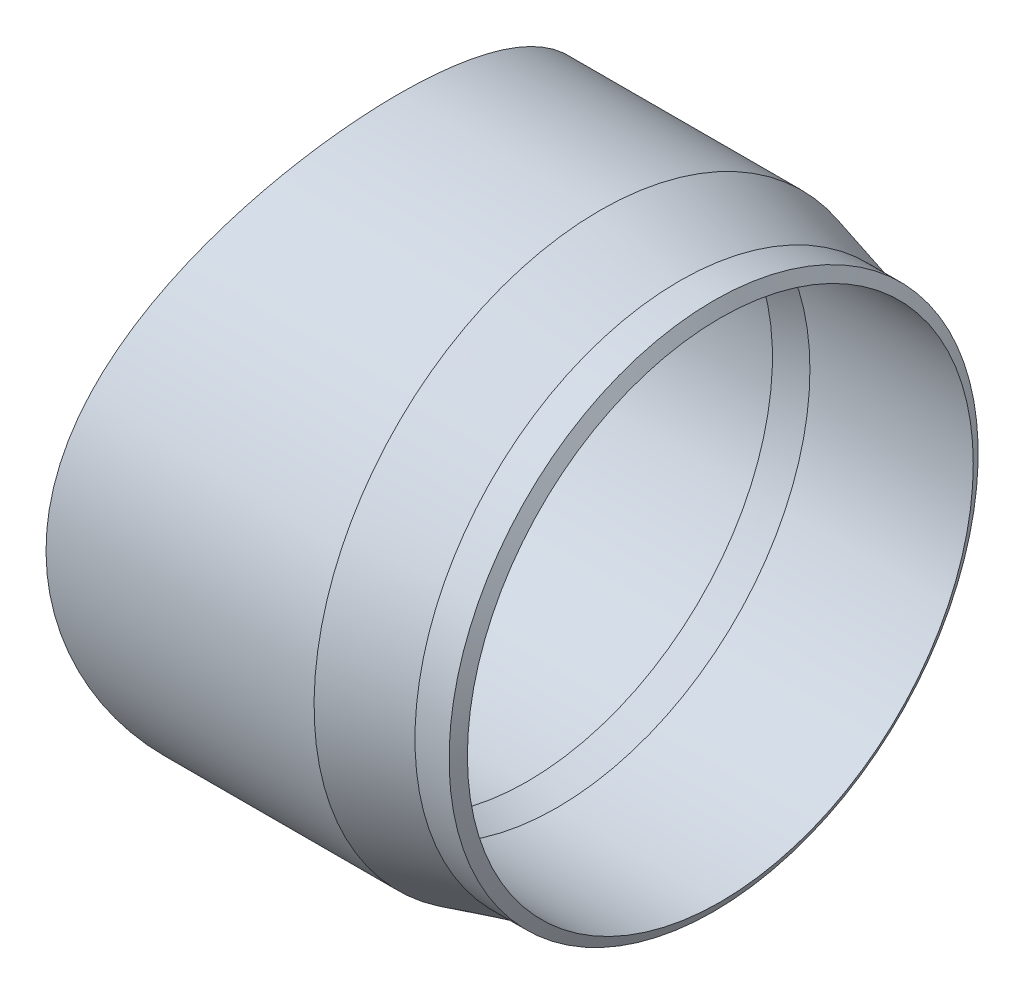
ISO-10303-21;
HEADER;
FILE_DESCRIPTION(('STEP AP214'),'2;1');
FILE_NAME('part.step','',(''),(''),'','','');
FILE_SCHEMA(('AUTOMOTIVE_DESIGN { 1 0 10303 214 1 1 1 1 }'));
ENDSEC;
DATA;
#1=APPLICATION_CONTEXT('core data for automotive mechanical design processes');
#2=APPLICATION_PROTOCOL_DEFINITION('international standard','automotive_design',2000,#1);
#3=PRODUCT_CONTEXT('',#1,'mechanical');
#4=PRODUCT('Part','Part','',(#3));
#5=PRODUCT_RELATED_PRODUCT_CATEGORY('part','',(#4));
#6=PRODUCT_DEFINITION_FORMATION('','',#4);
#7=PRODUCT_DEFINITION_CONTEXT('part definition',#1,'design');
#8=PRODUCT_DEFINITION('design','',#6,#7);
#9=PRODUCT_DEFINITION_SHAPE('','',#8);
#10=(LENGTH_UNIT() NAMED_UNIT(*) SI_UNIT(.MILLI.,.METRE.));
#11=(NAMED_UNIT(*) PLANE_ANGLE_UNIT() SI_UNIT($,.RADIAN.));
#12=(NAMED_UNIT(*) SI_UNIT($,.STERADIAN.) SOLID_ANGLE_UNIT());
#13=UNCERTAINTY_MEASURE_WITH_UNIT(LENGTH_MEASURE(1.E-05),#10,'distance_accuracy_value','');
#14=(GEOMETRIC_REPRESENTATION_CONTEXT(3) GLOBAL_UNCERTAINTY_ASSIGNED_CONTEXT((#13)) GLOBAL_UNIT_ASSIGNED_CONTEXT((#10,
#11,#12)) REPRESENTATION_CONTEXT('',''));
#15=CARTESIAN_POINT('',(0.,0.,0.));
#16=DIRECTION('',(0.,0.,1.));
#17=DIRECTION('',(1.,0.,0.));
#18=AXIS2_PLACEMENT_3D('',#15,#16,#17);
#19=CARTESIAN_POINT('',(561.325895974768,0.,0.));
#20=DIRECTION('',(1.,0.,0.));
#21=DIRECTION('',(0.,1.,0.));
#22=AXIS2_PLACEMENT_3D('',#19,#20,#21);
#23=CYLINDRICAL_SURFACE('',#22,161.95);
#24=CARTESIAN_POINT('',(517.900813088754,0.,0.));
#25=DIRECTION('',(1.,0.,0.));
#26=DIRECTION('',(0.,1.,0.));
#27=AXIS2_PLACEMENT_3D('',#24,#25,#26);
#28=CIRCLE('',#27,161.95);
#29=CARTESIAN_POINT('',(517.900813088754,161.95,0.));
#30=VERTEX_POINT('',#29);
#31=EDGE_CURVE('E12',#30,#30,#28,.F.);
#32=ORIENTED_EDGE('',*,*,#31,.T.);
#33=EDGE_LOOP('',(#32));
#34=FACE_BOUND('',#33,.T.);
#35=CARTESIAN_POINT('',(497.,0.,0.));
#36=DIRECTION('',(1.,0.,0.));
#37=DIRECTION('',(0.,1.,0.));
#38=AXIS2_PLACEMENT_3D('',#35,#36,#37);
#39=CIRCLE('',#38,161.95);
#40=CARTESIAN_POINT('',(497.,161.95,0.));
#41=VERTEX_POINT('',#40);
#42=EDGE_CURVE('E68',#41,#41,#39,.T.);
#43=ORIENTED_EDGE('',*,*,#42,.T.);
#44=EDGE_LOOP('',(#43));
#45=FACE_BOUND('',#44,.T.);
#46=ADVANCED_FACE('F43',(#34,#45),#23,.T.);
#47=CARTESIAN_POINT('',(497.,0.,0.));
#48=DIRECTION('',(-1.,0.,0.));
#49=DIRECTION('',(0.,-1.,0.));
#50=AXIS2_PLACEMENT_3D('',#47,#48,#49);
#51=CONICAL_SURFACE('',#50,161.95,0.261799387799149);
#52=CARTESIAN_POINT('',(448.296736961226,0.,0.));
#53=DIRECTION('',(1.,0.,0.));
#54=DIRECTION('',(0.,1.,0.));
#55=AXIS2_PLACEMENT_3D('',#52,#53,#54);
#56=CIRCLE('',#55,175.);
#57=CARTESIAN_POINT('',(448.296736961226,175.,0.));
#58=VERTEX_POINT('',#57);
#59=EDGE_CURVE('E73',#58,#58,#56,.T.);
#60=ORIENTED_EDGE('',*,*,#59,.T.);
#61=EDGE_LOOP('',(#60));
#62=FACE_BOUND('',#61,.T.);
#63=ORIENTED_EDGE('',*,*,#42,.F.);
#64=EDGE_LOOP('',(#63));
#65=FACE_BOUND('',#64,.T.);
#66=ADVANCED_FACE('F137',(#62,#65),#51,.T.);
#67=CARTESIAN_POINT('',(561.325895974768,0.,0.));
#68=DIRECTION('',(1.,0.,0.));
#69=DIRECTION('',(0.,1.,0.));
#70=AXIS2_PLACEMENT_3D('',#67,#68,#69);
#71=CYLINDRICAL_SURFACE('',#70,175.);
#72=CARTESIAN_POINT('',(324.999934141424,175.,0.));
#73=CARTESIAN_POINT('',(324.999910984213,174.999951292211,-5.79695561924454));
#74=CARTESIAN_POINT('',(324.874069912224,174.712618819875,-11.5692357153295));
#75=CARTESIAN_POINT('',(324.376401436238,173.569874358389,-23.0617467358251));
#76=CARTESIAN_POINT('',(324.004070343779,172.713305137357,-28.7847832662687));
#77=CARTESIAN_POINT('',(323.019603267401,170.426870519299,-40.1704184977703));
#78=CARTESIAN_POINT('',(322.400858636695,168.981192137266,-45.8683606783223));
#79=CARTESIAN_POINT('',(320.970665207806,165.59355407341,-56.8922309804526));
#80=CARTESIAN_POINT('',(320.154035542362,163.63976900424,-62.2878652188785));
#81=CARTESIAN_POINT('',(317.447563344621,157.04688384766,-78.0394641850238));
#82=CARTESIAN_POINT('',(315.292142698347,151.664513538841,-88.0569181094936));
#83=CARTESIAN_POINT('',(310.479254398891,138.897736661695,-107.067603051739));
#84=CARTESIAN_POINT('',(307.90039282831,131.714997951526,-115.764730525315));
#85=CARTESIAN_POINT('',(303.981587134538,119.811414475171,-127.679766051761));
#86=CARTESIAN_POINT('',(302.662705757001,115.638832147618,-131.470639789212));
#87=CARTESIAN_POINT('',(300.043320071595,106.901603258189,-138.669610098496));
#88=CARTESIAN_POINT('',(298.738895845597,102.31913380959,-142.085721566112));
#89=CARTESIAN_POINT('',(294.977245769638,88.1951827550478,-151.573402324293));
#90=CARTESIAN_POINT('',(292.651781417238,78.2379473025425,-156.955760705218));
#91=CARTESIAN_POINT('',(289.647066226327,62.3437007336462,-163.620396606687));
#92=CARTESIAN_POINT('',(288.728506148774,56.8761011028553,-165.600664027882));
#93=CARTESIAN_POINT('',(287.132687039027,45.8535957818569,-168.983569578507));
#94=CARTESIAN_POINT('',(286.448210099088,40.2640070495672,-170.402807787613));
#95=CARTESIAN_POINT('',(285.336318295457,28.9496858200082,-172.685321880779));
#96=CARTESIAN_POINT('',(284.908250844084,23.2167739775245,-173.550161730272));
#97=CARTESIAN_POINT('',(284.331134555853,11.6175381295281,-174.712053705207));
#98=CARTESIAN_POINT('',(284.184247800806,5.70078275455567,-175.004931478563));
#99=CARTESIAN_POINT('',(284.18922634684,-5.94717137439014,-174.994981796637));
#100=CARTESIAN_POINT('',(284.336515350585,-11.7374460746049,-174.701258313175));
#101=CARTESIAN_POINT('',(284.90903406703,-23.2207192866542,-173.548546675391));
#102=CARTESIAN_POINT('',(285.334007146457,-28.9204484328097,-172.690006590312));
#103=CARTESIAN_POINT('',(286.444286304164,-40.2297706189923,-170.410922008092));
#104=CARTESIAN_POINT('',(287.132193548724,-45.8573587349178,-168.984865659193));
#105=CARTESIAN_POINT('',(288.742233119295,-56.9636722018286,-165.571311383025));
#106=CARTESIAN_POINT('',(289.649000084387,-62.3476560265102,-163.615895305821));
#107=CARTESIAN_POINT('',(291.631599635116,-72.8476200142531,-159.218795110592));
#108=CARTESIAN_POINT('',(292.706332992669,-77.9557463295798,-156.779448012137));
#109=CARTESIAN_POINT('',(294.985198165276,-87.9020019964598,-151.426988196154));
#110=CARTESIAN_POINT('',(296.190155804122,-92.7422937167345,-148.511664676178));
#111=CARTESIAN_POINT('',(298.691713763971,-102.148817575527,-142.207193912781));
#112=CARTESIAN_POINT('',(299.997220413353,-106.742084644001,-138.792123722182));
#113=CARTESIAN_POINT('',(302.610389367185,-115.469822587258,-131.618431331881));
#114=CARTESIAN_POINT('',(303.928120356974,-119.644094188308,-127.835767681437));
#115=CARTESIAN_POINT('',(306.541910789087,-127.593220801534,-119.901411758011));
#116=CARTESIAN_POINT('',(307.842130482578,-131.382061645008,-115.739056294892));
#117=CARTESIAN_POINT('',(310.389064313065,-138.567019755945,-107.033234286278));
#118=CARTESIAN_POINT('',(311.641278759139,-141.97799582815,-102.46929919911));
#119=CARTESIAN_POINT('',(314.046449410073,-148.3622290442,-92.9854367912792));
#120=CARTESIAN_POINT('',(315.184756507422,-151.298079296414,-88.1261518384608));
#121=CARTESIAN_POINT('',(317.320027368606,-156.699371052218,-78.1193611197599));
#122=CARTESIAN_POINT('',(318.31506091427,-159.159291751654,-72.9750991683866));
#123=CARTESIAN_POINT('',(321.041700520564,-165.803654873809,-57.152382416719));
#124=CARTESIAN_POINT('',(322.522780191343,-169.27304118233,-45.900122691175));
#125=CARTESIAN_POINT('',(324.48203556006,-173.823333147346,-23.2726893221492));
#126=CARTESIAN_POINT('',(324.998831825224,-174.997567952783,-11.7381445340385));
#127=CARTESIAN_POINT('',(325.000485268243,-175.001215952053,5.87520138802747));
#128=CARTESIAN_POINT('',(324.8699373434,-174.703180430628,11.7511531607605));
#129=CARTESIAN_POINT('',(324.356937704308,-173.525128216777,23.4204981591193));
#130=CARTESIAN_POINT('',(323.97228001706,-172.639895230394,29.2317385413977));
#131=CARTESIAN_POINT('',(322.478626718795,-169.169539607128,46.2594277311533));
#132=CARTESIAN_POINT('',(321.031980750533,-165.779249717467,57.1964846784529));
#133=CARTESIAN_POINT('',(318.313137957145,-159.154966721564,72.9924348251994));
#134=CARTESIAN_POINT('',(317.310322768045,-156.675590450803,78.1718562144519));
#135=CARTESIAN_POINT('',(315.148724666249,-151.206150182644,88.2878499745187));
#136=CARTESIAN_POINT('',(314.007310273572,-148.259675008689,93.1450148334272));
#137=CARTESIAN_POINT('',(311.628260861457,-141.942074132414,102.515264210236));
#138=CARTESIAN_POINT('',(310.391722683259,-138.57392769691,107.022696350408));
#139=CARTESIAN_POINT('',(307.855672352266,-131.420850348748,115.694208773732));
#140=CARTESIAN_POINT('',(306.555714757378,-127.634581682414,119.858901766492));
#141=CARTESIAN_POINT('',(303.925858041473,-119.637834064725,127.84324277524));
#142=CARTESIAN_POINT('',(302.590219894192,-115.405703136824,131.676137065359));
#143=CARTESIAN_POINT('',(299.978842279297,-106.677408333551,138.840205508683));
#144=CARTESIAN_POINT('',(298.692465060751,-102.150172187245,142.204602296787));
#145=CARTESIAN_POINT('',(296.200390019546,-92.782238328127,148.486566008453));
#146=CARTESIAN_POINT('',(294.992677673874,-87.9337375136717,151.409313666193));
#147=CARTESIAN_POINT('',(292.697645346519,-77.918737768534,156.799960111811));
#148=CARTESIAN_POINT('',(291.603607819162,-72.7138561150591,159.282579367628));
#149=CARTESIAN_POINT('',(288.60892473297,-56.809667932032,165.919146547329));
#150=CARTESIAN_POINT('',(286.996801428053,-45.8669650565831,169.277473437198));
#151=CARTESIAN_POINT('',(285.322443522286,-28.7978775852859,172.713388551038));
#152=CARTESIAN_POINT('',(284.89159082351,-22.9743371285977,173.583817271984));
#153=CARTESIAN_POINT('',(284.32436929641,-11.3852326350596,174.725556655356));
#154=CARTESIAN_POINT('',(284.183672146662,-5.59407301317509,175.006085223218));
#155=CARTESIAN_POINT('',(284.189858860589,5.96866868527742,174.993714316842));
#156=CARTESIAN_POINT('',(284.336556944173,11.7452099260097,174.701186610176));
#157=CARTESIAN_POINT('',(284.911934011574,23.2719056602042,173.542695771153));
#158=CARTESIAN_POINT('',(285.34383105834,29.0541395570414,172.670151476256));
#159=CARTESIAN_POINT('',(286.473618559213,40.4937533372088,170.35038813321));
#160=CARTESIAN_POINT('',(287.160941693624,46.0676364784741,168.924438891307));
#161=CARTESIAN_POINT('',(288.748820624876,56.9968856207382,165.556807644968));
#162=CARTESIAN_POINT('',(289.648428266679,62.3430698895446,163.617015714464));
#163=CARTESIAN_POINT('',(291.624130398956,72.809614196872,159.23550786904));
#164=CARTESIAN_POINT('',(292.700740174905,77.931168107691,156.79244747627));
#165=CARTESIAN_POINT('',(294.995653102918,87.9477998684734,151.402568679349));
#166=CARTESIAN_POINT('',(296.219132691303,92.8585805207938,148.44119041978));
#167=CARTESIAN_POINT('',(299.974800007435,106.958688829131,138.968335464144));
#168=CARTESIAN_POINT('',(302.605711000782,115.618455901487,131.844200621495));
#169=CARTESIAN_POINT('',(306.532566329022,127.56673917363,119.932683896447));
#170=CARTESIAN_POINT('',(307.842482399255,131.383899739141,115.739628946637));
#171=CARTESIAN_POINT('',(310.409623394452,138.62416489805,106.961168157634));
#172=CARTESIAN_POINT('',(311.652967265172,142.009285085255,102.424632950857));
#173=CARTESIAN_POINT('',(315.217907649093,151.471194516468,88.3633955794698));
#174=CARTESIAN_POINT('',(317.387671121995,156.900088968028,78.3653182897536));
#175=CARTESIAN_POINT('',(321.061142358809,165.850340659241,57.0309895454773));
#176=CARTESIAN_POINT('',(322.504647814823,169.230317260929,46.0195044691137));
#177=CARTESIAN_POINT('',(323.98515654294,172.669649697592,29.0553743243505));
#178=CARTESIAN_POINT('',(324.363412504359,173.540023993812,23.3085963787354));
#179=CARTESIAN_POINT('',(324.873692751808,174.711777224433,11.6296770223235));
#180=CARTESIAN_POINT('',(324.999957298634,175.000048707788,5.79695561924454));
#181=CARTESIAN_POINT('',(324.999934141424,175.,0.));
#182=B_SPLINE_CURVE_WITH_KNOTS('',3,(#72,#73,#74,#75,#76,#77,#78,#79,#80,#81,#82,#83,#84,#85,
#86,#87,#88,#89,#90,#91,#92,#93,#94,#95,#96,#97,#98,#99,#100,#101,#102,#103,#104,#105,#106,#107,
#108,#109,#110,#111,#112,#113,#114,#115,#116,#117,#118,#119,#120,#121,#122,#123,#124,#125,#126,
#127,#128,#129,#130,#131,#132,#133,#134,#135,#136,#137,#138,#139,#140,#141,#142,#143,#144,#145,
#146,#147,#148,#149,#150,#151,#152,#153,#154,#155,#156,#157,#158,#159,#160,#161,#162,#163,#164,
#165,#166,#167,#168,#169,#170,#171,#172,#173,#174,#175,#176,#177,#178,#179,#180,#181),
.UNSPECIFIED.,.T.,.F.,(4,2,2,2,2,2,2,2,2,2,2,2,2,2,2,2,2,2,2,2,2,2,2,2,2,2,2,2,2,2,2,2,2,2,2,2,
2,2,2,2,2,2,2,2,2,2,2,2,2,2,2,2,2,2,4),(-0.962254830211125,-0.94663455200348,-0.931014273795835,
-0.915393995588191,-0.899773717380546,-0.868533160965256,-0.837292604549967,-0.821672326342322,
-0.806052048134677,-0.774811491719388,-0.759191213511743,-0.743570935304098,-0.727950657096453,
-0.712330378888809,-0.696710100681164,-0.681089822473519,-0.665469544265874,-0.649849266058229,
-0.634228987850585,-0.61860870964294,-0.602988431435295,-0.58736815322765,-0.571747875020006,
-0.556127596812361,-0.540507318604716,-0.524887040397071,-0.493646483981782,-0.462405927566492,
-0.446785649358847,-0.431165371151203,-0.399924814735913,-0.384304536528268,-0.368684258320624,
-0.353063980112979,-0.337443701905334,-0.321823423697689,-0.306203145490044,-0.2905828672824,
-0.274962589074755,-0.243722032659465,-0.228101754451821,-0.212481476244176,-0.196861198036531,
-0.181240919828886,-0.165620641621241,-0.150000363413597,-0.134380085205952,-0.118759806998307,
-0.0875192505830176,-0.0718989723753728,-0.056278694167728,-0.0250381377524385,
0.0062024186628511,0.0218226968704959,0.0374429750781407),.UNSPECIFIED.);
#183=CARTESIAN_POINT('',(324.999934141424,175.,0.));
#184=VERTEX_POINT('',#183);
#185=EDGE_CURVE('E58',#184,#184,#182,.F.);
#186=ORIENTED_EDGE('',*,*,#185,.T.);
#187=EDGE_LOOP('',(#186));
#188=FACE_BOUND('',#187,.T.);
#189=ORIENTED_EDGE('',*,*,#59,.F.);
#190=EDGE_LOOP('',(#189));
#191=FACE_BOUND('',#190,.T.);
#192=ADVANCED_FACE('F127',(#188,#191),#71,.T.);
#193=CARTESIAN_POINT('',(422.,0.,0.));
#194=DIRECTION('',(1.,0.,0.));
#195=DIRECTION('',(0.,1.,0.));
#196=AXIS2_PLACEMENT_3D('',#193,#194,#195);
#197=CYLINDRICAL_SURFACE('',#196,154.85);
#198=CARTESIAN_POINT('',(422.,0.,0.));
#199=DIRECTION('',(1.,0.,0.));
#200=DIRECTION('',(0.,1.,0.));
#201=AXIS2_PLACEMENT_3D('',#198,#199,#200);
#202=CIRCLE('',#201,154.85);
#203=CARTESIAN_POINT('',(422.,154.85,0.));
#204=VERTEX_POINT('',#203);
#205=EDGE_CURVE('E84',#204,#204,#202,.T.);
#206=ORIENTED_EDGE('',*,*,#205,.F.);
#207=EDGE_LOOP('',(#206));
#208=FACE_BOUND('',#207,.T.);
#209=CARTESIAN_POINT('',(522.,0.,0.));
#210=DIRECTION('',(1.,0.,0.));
#211=DIRECTION('',(0.,1.,0.));
#212=AXIS2_PLACEMENT_3D('',#209,#210,#211);
#213=CIRCLE('',#212,154.85);
#214=CARTESIAN_POINT('',(522.,154.85,0.));
#215=VERTEX_POINT('',#214);
#216=EDGE_CURVE('E78',#215,#215,#213,.T.);
#217=ORIENTED_EDGE('',*,*,#216,.T.);
#218=EDGE_LOOP('',(#217));
#219=FACE_BOUND('',#218,.T.);
#220=ADVANCED_FACE('F136',(#208,#219),#197,.F.);
#221=CARTESIAN_POINT('',(422.,0.,0.));
#222=DIRECTION('',(1.,0.,0.));
#223=DIRECTION('',(0.,1.,0.));
#224=AXIS2_PLACEMENT_3D('',#221,#222,#223);
#225=CONICAL_SURFACE('',#224,154.85,0.26179938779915);
#226=CARTESIAN_POINT('',(403.899553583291,0.,0.));
#227=DIRECTION('',(1.,0.,0.));
#228=DIRECTION('',(0.,1.,0.));
#229=AXIS2_PLACEMENT_3D('',#226,#227,#228);
#230=CIRCLE('',#229,150.);
#231=CARTESIAN_POINT('',(403.899553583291,150.,0.));
#232=VERTEX_POINT('',#231);
#233=EDGE_CURVE('E82',#232,#232,#230,.F.);
#234=ORIENTED_EDGE('',*,*,#233,.T.);
#235=EDGE_LOOP('',(#234));
#236=FACE_BOUND('',#235,.T.);
#237=ORIENTED_EDGE('',*,*,#205,.T.);
#238=EDGE_LOOP('',(#237));
#239=FACE_BOUND('',#238,.T.);
#240=ADVANCED_FACE('F181',(#236,#239),#225,.F.);
#241=CARTESIAN_POINT('',(222.,0.,0.));
#242=DIRECTION('',(1.,0.,0.));
#243=DIRECTION('',(0.,1.,0.));
#244=AXIS2_PLACEMENT_3D('',#241,#242,#243);
#245=CYLINDRICAL_SURFACE('',#244,150.);
#246=CARTESIAN_POINT('',(320.000025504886,150.,0.));
#247=CARTESIAN_POINT('',(320.000039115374,150.000024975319,1.42489149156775));
#248=CARTESIAN_POINT('',(319.989835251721,149.979677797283,2.84977616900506));
#249=CARTESIAN_POINT('',(319.949069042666,149.898253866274,5.70375336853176));
#250=CARTESIAN_POINT('',(319.918426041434,149.837015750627,7.1328401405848));
#251=CARTESIAN_POINT('',(319.836723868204,149.673554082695,9.99287633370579));
#252=CARTESIAN_POINT('',(319.785596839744,149.571194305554,11.4238160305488));
#253=CARTESIAN_POINT('',(319.662886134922,149.325301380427,14.2835520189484));
#254=CARTESIAN_POINT('',(319.591270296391,149.181703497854,15.7123413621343));
#255=CARTESIAN_POINT('',(319.428377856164,148.854649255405,18.5569351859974));
#256=CARTESIAN_POINT('',(319.337201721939,148.671396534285,19.9727688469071));
#257=CARTESIAN_POINT('',(319.135648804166,148.265545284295,22.790944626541));
#258=CARTESIAN_POINT('',(319.025359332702,148.043125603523,24.1933187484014));
#259=CARTESIAN_POINT('',(318.786030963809,147.559466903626,26.9858924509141));
#260=CARTESIAN_POINT('',(318.657042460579,147.298332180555,28.3761144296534));
#261=CARTESIAN_POINT('',(318.380788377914,146.737809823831,31.1448668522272));
#262=CARTESIAN_POINT('',(318.233549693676,146.438478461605,32.5234113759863));
#263=CARTESIAN_POINT('',(317.921208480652,145.801771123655,35.2684372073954));
#264=CARTESIAN_POINT('',(317.756120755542,145.464426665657,36.6349275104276));
#265=CARTESIAN_POINT('',(317.408507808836,144.751916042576,39.3559434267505));
#266=CARTESIAN_POINT('',(317.225980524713,144.37674540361,40.7104676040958));
#267=CARTESIAN_POINT('',(316.843913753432,143.588840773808,43.4076366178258));
#268=CARTESIAN_POINT('',(316.644357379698,143.176069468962,44.750268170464));
#269=CARTESIAN_POINT('',(316.228633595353,142.313018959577,47.4235034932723));
#270=CARTESIAN_POINT('',(316.012436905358,141.862673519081,48.7540812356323));
#271=CARTESIAN_POINT('',(315.338246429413,140.452557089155,52.7356751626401));
#272=CARTESIAN_POINT('',(314.856527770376,139.437556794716,55.3633769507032));
#273=CARTESIAN_POINT('',(313.832390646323,137.258281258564,60.5651056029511));
#274=CARTESIAN_POINT('',(313.289589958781,136.093058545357,63.1386595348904));
#275=CARTESIAN_POINT('',(312.437815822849,134.243296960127,66.9377315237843));
#276=CARTESIAN_POINT('',(312.147880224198,133.610278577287,68.1928820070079));
#277=CARTESIAN_POINT('',(311.557421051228,132.313272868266,70.6765045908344));
#278=CARTESIAN_POINT('',(311.256955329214,131.649449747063,71.9050762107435));
#279=CARTESIAN_POINT('',(310.340979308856,129.612778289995,75.5525636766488));
#280=CARTESIAN_POINT('',(309.709263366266,128.19120815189,77.9404640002));
#281=CARTESIAN_POINT('',(308.411047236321,125.225616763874,82.6210514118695));
#282=CARTESIAN_POINT('',(307.744627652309,123.681875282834,84.9139387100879));
#283=CARTESIAN_POINT('',(306.381785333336,120.472019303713,89.4100438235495));
#284=CARTESIAN_POINT('',(305.685308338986,118.805679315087,91.6130842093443));
#285=CARTESIAN_POINT('',(304.268802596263,115.350530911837,95.9279209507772));
#286=CARTESIAN_POINT('',(303.548693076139,113.561273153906,98.0393308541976));
#287=CARTESIAN_POINT('',(302.091475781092,109.861252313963,102.168237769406));
#288=CARTESIAN_POINT('',(301.354298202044,107.949896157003,104.185178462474));
#289=CARTESIAN_POINT('',(299.875497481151,104.021400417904,108.107472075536));
#290=CARTESIAN_POINT('',(299.133879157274,102.004361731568,110.012927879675));
#291=CARTESIAN_POINT('',(297.657899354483,97.8771633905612,113.700251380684));
#292=CARTESIAN_POINT('',(296.923520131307,95.7675194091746,115.482689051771));
#293=CARTESIAN_POINT('',(295.467959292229,91.4538842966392,118.927487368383));
#294=CARTESIAN_POINT('',(294.74675860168,89.2500480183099,120.590033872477));
#295=CARTESIAN_POINT('',(293.324526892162,84.7487183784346,123.795242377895));
#296=CARTESIAN_POINT('',(292.623506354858,82.4511777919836,125.337842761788));
#297=CARTESIAN_POINT('',(291.248125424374,77.7572622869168,128.303098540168));
#298=CARTESIAN_POINT('',(290.573895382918,75.3604982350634,129.725198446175));
#299=CARTESIAN_POINT('',(289.261378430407,70.4732222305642,132.443836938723));
#300=CARTESIAN_POINT('',(288.623252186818,67.9823626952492,133.73983031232));
#301=CARTESIAN_POINT('',(287.703413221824,64.1922284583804,135.578228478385));
#302=CARTESIAN_POINT('',(287.403536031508,62.9222302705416,136.172445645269));
#303=CARTESIAN_POINT('',(286.817860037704,60.367359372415,137.323967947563));
#304=CARTESIAN_POINT('',(286.532019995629,59.0825458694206,137.881383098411));
#305=CARTESIAN_POINT('',(285.975142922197,56.4984209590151,138.959799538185));
#306=CARTESIAN_POINT('',(285.704071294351,55.1991528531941,139.480886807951));
#307=CARTESIAN_POINT('',(285.177175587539,52.5853415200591,140.48733557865));
#308=CARTESIAN_POINT('',(284.921336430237,51.2708149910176,140.97273252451));
#309=CARTESIAN_POINT('',(284.425751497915,48.62605593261,141.907298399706));
#310=CARTESIAN_POINT('',(284.186004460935,47.2958246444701,142.356470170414));
#311=CARTESIAN_POINT('',(283.723387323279,44.619323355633,143.218311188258));
#312=CARTESIAN_POINT('',(283.500532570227,43.2730400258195,143.630947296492));
#313=CARTESIAN_POINT('',(283.072490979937,40.5640763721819,144.419391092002));
#314=CARTESIAN_POINT('',(282.867338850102,39.2013695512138,144.795126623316));
#315=CARTESIAN_POINT('',(282.475509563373,36.459198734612,145.509440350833));
#316=CARTESIAN_POINT('',(282.288889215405,35.0796969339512,145.847904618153));
#317=CARTESIAN_POINT('',(281.934842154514,32.3036003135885,146.487428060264));
#318=CARTESIAN_POINT('',(281.76749659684,30.9069587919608,146.788329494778));
#319=CARTESIAN_POINT('',(281.453847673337,28.1033473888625,147.350725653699));
#320=CARTESIAN_POINT('',(281.307545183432,26.6963770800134,147.612218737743));
#321=CARTESIAN_POINT('',(281.037345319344,23.8794550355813,148.093993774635));
#322=CARTESIAN_POINT('',(280.9133554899,22.4695412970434,148.314445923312));
#323=CARTESIAN_POINT('',(280.687818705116,19.6472806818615,148.714450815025));
#324=CARTESIAN_POINT('',(280.58619352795,18.2349602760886,148.894146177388));
#325=CARTESIAN_POINT('',(280.405512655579,15.4084064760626,149.212861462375));
#326=CARTESIAN_POINT('',(280.326393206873,13.9941901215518,149.3519963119));
#327=CARTESIAN_POINT('',(280.19082034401,11.1643696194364,149.589853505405));
#328=CARTESIAN_POINT('',(280.13431820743,9.74877511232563,149.688662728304));
#329=CARTESIAN_POINT('',(280.044105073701,6.91671913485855,149.846065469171));
#330=CARTESIAN_POINT('',(280.010360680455,5.50026200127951,149.904717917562));
#331=CARTESIAN_POINT('',(279.965701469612,2.66700156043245,149.982230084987));
#332=CARTESIAN_POINT('',(279.954768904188,1.25019938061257,150.001120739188));
#333=CARTESIAN_POINT('',(279.95608854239,-1.58503456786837,149.998692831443));
#334=CARTESIAN_POINT('',(279.968368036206,-3.00346629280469,149.977326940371));
#335=CARTESIAN_POINT('',(280.016212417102,-5.84337709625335,149.893756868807));
#336=CARTESIAN_POINT('',(280.051853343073,-7.26485096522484,149.831419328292));
#337=CARTESIAN_POINT('',(280.146267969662,-10.1105720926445,149.665987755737));
#338=CARTESIAN_POINT('',(280.205137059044,-11.5348063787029,149.562725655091));
#339=CARTESIAN_POINT('',(280.345884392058,-14.3850751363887,149.315461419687));
#340=CARTESIAN_POINT('',(280.427865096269,-15.8110888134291,149.171277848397));
#341=CARTESIAN_POINT('',(280.614630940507,-18.6584311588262,148.842021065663));
#342=CARTESIAN_POINT('',(280.719440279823,-20.0797532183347,148.656904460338));
#343=CARTESIAN_POINT('',(280.950848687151,-22.9121890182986,148.246919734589));
#344=CARTESIAN_POINT('',(281.07740744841,-24.3233166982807,148.022125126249));
#345=CARTESIAN_POINT('',(281.351588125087,-27.1302618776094,147.533422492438));
#346=CARTESIAN_POINT('',(281.499114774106,-28.5261194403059,147.269691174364));
#347=CARTESIAN_POINT('',(281.814265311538,-31.301278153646,146.704258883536));
#348=CARTESIAN_POINT('',(281.981796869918,-32.6806253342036,146.402732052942));
#349=CARTESIAN_POINT('',(282.33588187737,-35.4250303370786,145.762613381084));
#350=CARTESIAN_POINT('',(282.522393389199,-36.7901126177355,145.424103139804));
#351=CARTESIAN_POINT('',(282.913811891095,-39.5059748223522,144.710021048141));
#352=CARTESIAN_POINT('',(283.118694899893,-40.8567708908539,144.334497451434));
#353=CARTESIAN_POINT('',(283.546070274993,-43.5441328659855,143.546702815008));
#354=CARTESIAN_POINT('',(283.768554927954,-44.880704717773,143.134447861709));
#355=CARTESIAN_POINT('',(284.230389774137,-47.5396758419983,142.273433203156));
#356=CARTESIAN_POINT('',(284.469746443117,-48.8620694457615,141.824659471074));
#357=CARTESIAN_POINT('',(284.964583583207,-51.4927252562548,140.890814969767));
#358=CARTESIAN_POINT('',(285.220082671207,-52.8009690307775,140.405702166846));
#359=CARTESIAN_POINT('',(285.746424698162,-55.4034549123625,139.39958633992));
#360=CARTESIAN_POINT('',(286.017296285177,-56.6976651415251,138.878515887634));
#361=CARTESIAN_POINT('',(286.574047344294,-59.2731784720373,137.799571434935));
#362=CARTESIAN_POINT('',(286.859978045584,-60.5544171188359,137.241569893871));
#363=CARTESIAN_POINT('',(287.446018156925,-63.1035280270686,136.088459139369));
#364=CARTESIAN_POINT('',(287.74618220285,-64.3713212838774,135.49320356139));
#365=CARTESIAN_POINT('',(288.666800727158,-68.1550457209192,133.651791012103));
#366=CARTESIAN_POINT('',(289.305294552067,-70.6417327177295,132.354010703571));
#367=CARTESIAN_POINT('',(290.617707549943,-75.5182054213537,129.633216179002));
#368=CARTESIAN_POINT('',(291.29143004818,-77.908419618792,128.210872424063));
#369=CARTESIAN_POINT('',(292.66538241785,-82.5898797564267,125.246180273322));
#370=CARTESIAN_POINT('',(293.365484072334,-84.8815113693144,123.704381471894));
#371=CARTESIAN_POINT('',(294.785245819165,-89.3693115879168,120.502001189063));
#372=CARTESIAN_POINT('',(295.504880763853,-91.5655942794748,118.841568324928));
#373=CARTESIAN_POINT('',(296.956915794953,-95.8641777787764,115.402147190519));
#374=CARTESIAN_POINT('',(297.689332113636,-97.9663448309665,113.62299861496));
#375=CARTESIAN_POINT('',(299.160806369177,-102.0781170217,109.944202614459));
#376=CARTESIAN_POINT('',(299.899879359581,-104.087266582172,108.044052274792));
#377=CARTESIAN_POINT('',(301.376660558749,-108.008166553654,104.124576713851));
#378=CARTESIAN_POINT('',(302.114343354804,-109.91937823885,102.104701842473));
#379=CARTESIAN_POINT('',(303.210173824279,-112.700067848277,98.9978969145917));
#380=CARTESIAN_POINT('',(303.573373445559,-113.611893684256,97.9503580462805));
#381=CARTESIAN_POINT('',(304.293893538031,-115.402930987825,95.8336688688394));
#382=CARTESIAN_POINT('',(304.651232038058,-116.282261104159,94.7646250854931));
#383=CARTESIAN_POINT('',(305.71350466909,-118.872385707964,91.5255050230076));
#384=CARTESIAN_POINT('',(306.410587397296,-120.540092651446,89.3180979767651));
#385=CARTESIAN_POINT('',(307.774873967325,-123.75242598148,84.8115072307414));
#386=CARTESIAN_POINT('',(308.44211647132,-125.297213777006,82.5124500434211));
#387=CARTESIAN_POINT('',(309.741265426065,-128.26348987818,77.8212019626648));
#388=CARTESIAN_POINT('',(310.373118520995,-129.684793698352,75.4288792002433));
#389=CARTESIAN_POINT('',(311.289096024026,-131.720602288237,71.7746912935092));
#390=CARTESIAN_POINT('',(311.589518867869,-132.384039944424,70.5439124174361));
#391=CARTESIAN_POINT('',(312.179687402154,-133.679853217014,68.0564086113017));
#392=CARTESIAN_POINT('',(312.469380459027,-134.312079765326,66.7995935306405));
#393=CARTESIAN_POINT('',(313.319465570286,-136.157429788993,62.9995724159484));
#394=CARTESIAN_POINT('',(313.860840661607,-137.319172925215,60.4268815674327));
#395=CARTESIAN_POINT('',(314.881975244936,-139.491335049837,55.2275288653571));
#396=CARTESIAN_POINT('',(315.36212765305,-140.502726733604,52.6013512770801));
#397=CARTESIAN_POINT('',(316.034380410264,-141.908430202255,48.6204796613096));
#398=CARTESIAN_POINT('',(316.250134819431,-142.357748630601,47.2889404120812));
#399=CARTESIAN_POINT('',(316.665029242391,-143.218878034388,44.6131143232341));
#400=CARTESIAN_POINT('',(316.864190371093,-143.630736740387,43.2688461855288));
#401=CARTESIAN_POINT('',(317.245490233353,-144.416880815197,40.5674146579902));
#402=CARTESIAN_POINT('',(317.427633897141,-144.791177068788,39.2102551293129));
#403=CARTESIAN_POINT('',(317.774518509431,-145.502047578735,36.4831214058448));
#404=CARTESIAN_POINT('',(317.939250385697,-145.838602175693,35.1131409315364));
#405=CARTESIAN_POINT('',(318.251078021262,-146.47412590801,32.3605898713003));
#406=CARTESIAN_POINT('',(318.398150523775,-146.773045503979,30.9780052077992));
#407=CARTESIAN_POINT('',(318.673937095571,-147.332597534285,28.1986034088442));
#408=CARTESIAN_POINT('',(318.802590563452,-147.593103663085,26.8017547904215));
#409=CARTESIAN_POINT('',(319.040919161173,-148.074972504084,23.9940722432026));
#410=CARTESIAN_POINT('',(319.150518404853,-148.296178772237,22.5832050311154));
#411=CARTESIAN_POINT('',(319.350460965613,-148.699120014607,19.7503997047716));
#412=CARTESIAN_POINT('',(319.440748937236,-148.880741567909,18.3284415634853));
#413=CARTESIAN_POINT('',(319.601619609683,-149.203880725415,15.4762969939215));
#414=CARTESIAN_POINT('',(319.672167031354,-149.3453265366,14.0461004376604));
#415=CARTESIAN_POINT('',(319.79314033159,-149.587541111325,11.1803445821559));
#416=CARTESIAN_POINT('',(319.843551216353,-149.688279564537,9.74478208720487));
#417=CARTESIAN_POINT('',(319.923874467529,-149.848575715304,6.87115854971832));
#418=CARTESIAN_POINT('',(319.953792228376,-149.908144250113,5.43309826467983));
#419=CARTESIAN_POINT('',(319.99256060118,-149.985260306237,2.55734334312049));
#420=CARTESIAN_POINT('',(320.001437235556,-150.002859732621,1.11965045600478));
#421=CARTESIAN_POINT('',(319.998281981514,-149.996477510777,-1.7505199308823));
#422=CARTESIAN_POINT('',(319.986323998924,-149.972642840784,-3.18299787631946));
#423=CARTESIAN_POINT('',(319.942233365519,-149.884582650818,-6.03998222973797));
#424=CARTESIAN_POINT('',(319.910191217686,-149.820538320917,-7.46449562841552));
#425=CARTESIAN_POINT('',(319.826023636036,-149.652130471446,-10.305747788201));
#426=CARTESIAN_POINT('',(319.773965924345,-149.547902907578,-11.7224966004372));
#427=CARTESIAN_POINT('',(319.65003688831,-149.299541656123,-14.5483980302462));
#428=CARTESIAN_POINT('',(319.578210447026,-149.155498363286,-15.9575605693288));
#429=CARTESIAN_POINT('',(319.415105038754,-148.827971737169,-18.7683275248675));
#430=CARTESIAN_POINT('',(319.323851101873,-148.644539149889,-20.1699393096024));
#431=CARTESIAN_POINT('',(319.122164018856,-148.23836550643,-22.9656278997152));
#432=CARTESIAN_POINT('',(319.01173675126,-148.015636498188,-24.359706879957));
#433=CARTESIAN_POINT('',(318.771977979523,-147.531036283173,-27.1403719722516));
#434=CARTESIAN_POINT('',(318.642633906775,-147.269139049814,-28.5269524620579));
#435=CARTESIAN_POINT('',(318.365360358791,-146.70645952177,-31.2923375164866));
#436=CARTESIAN_POINT('',(318.21740551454,-146.405624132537,-32.6711287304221));
#437=CARTESIAN_POINT('',(317.903113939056,-145.764825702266,-35.4211279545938));
#438=CARTESIAN_POINT('',(317.736732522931,-145.424767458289,-36.7923086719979));
#439=CARTESIAN_POINT('',(317.385728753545,-144.705133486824,-39.5278874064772));
#440=CARTESIAN_POINT('',(317.201035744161,-144.32540435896,-40.8922359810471));
#441=CARTESIAN_POINT('',(316.813691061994,-143.526379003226,-43.6140855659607));
#442=CARTESIAN_POINT('',(316.610956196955,-143.106898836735,-44.9715207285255));
#443=CARTESIAN_POINT('',(316.188671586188,-142.229860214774,-47.6729673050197));
#444=CARTESIAN_POINT('',(315.969104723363,-141.772262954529,-49.0169634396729));
#445=CARTESIAN_POINT('',(315.514537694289,-140.820979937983,-51.6868971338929));
#446=CARTESIAN_POINT('',(315.279563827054,-140.327355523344,-53.0128610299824));
#447=CARTESIAN_POINT('',(314.79532495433,-139.305465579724,-55.6426246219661));
#448=CARTESIAN_POINT('',(314.546119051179,-138.777342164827,-56.9464904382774));
#449=CARTESIAN_POINT('',(314.034356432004,-137.6876632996,-59.5314104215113));
#450=CARTESIAN_POINT('',(313.771854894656,-137.126244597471,-60.8125331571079));
#451=CARTESIAN_POINT('',(313.234166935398,-135.970365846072,-63.3541081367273));
#452=CARTESIAN_POINT('',(312.95900454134,-135.375967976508,-64.6145938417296));
#453=CARTESIAN_POINT('',(312.115597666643,-133.543740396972,-68.3639220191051));
#454=CARTESIAN_POINT('',(311.52873151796,-132.255388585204,-70.824163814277));
#455=CARTESIAN_POINT('',(310.3118322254,-129.548062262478,-75.6626280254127));
#456=CARTESIAN_POINT('',(309.681770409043,-128.129000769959,-78.0407943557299));
#457=CARTESIAN_POINT('',(308.383306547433,-125.161480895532,-82.7175610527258));
#458=CARTESIAN_POINT('',(307.71476752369,-123.612549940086,-85.0158236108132));
#459=CARTESIAN_POINT('',(306.344197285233,-120.382383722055,-89.5322221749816));
#460=CARTESIAN_POINT('',(305.641968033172,-118.700314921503,-91.7497015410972));
#461=CARTESIAN_POINT('',(304.215871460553,-115.218250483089,-96.0857817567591));
#462=CARTESIAN_POINT('',(303.491987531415,-113.41816299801,-98.2043033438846));
#463=CARTESIAN_POINT('',(302.035468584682,-109.716293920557,-102.323114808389));
#464=CARTESIAN_POINT('',(301.302911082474,-107.815179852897,-104.32403219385));
#465=CARTESIAN_POINT('',(299.834680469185,-103.911068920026,-108.213013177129));
#466=CARTESIAN_POINT('',(299.099018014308,-101.908309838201,-110.101319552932));
#467=CARTESIAN_POINT('',(297.631105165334,-97.8006472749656,-113.765788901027));
#468=CARTESIAN_POINT('',(296.898855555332,-95.695721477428,-115.541927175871));
#469=CARTESIAN_POINT('',(295.444343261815,-91.3826922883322,-118.982541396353));
#470=CARTESIAN_POINT('',(294.722114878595,-89.174312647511,-120.646685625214));
#471=CARTESIAN_POINT('',(293.294378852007,-84.6515450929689,-123.862401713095));
#472=CARTESIAN_POINT('',(292.588990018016,-82.3366245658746,-125.413277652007));
#473=CARTESIAN_POINT('',(291.210116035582,-77.6227101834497,-128.383889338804));
#474=CARTESIAN_POINT('',(290.536561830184,-75.2239199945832,-129.803915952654));
#475=CARTESIAN_POINT('',(289.230576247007,-70.3511975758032,-132.507364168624));
#476=CARTESIAN_POINT('',(288.598010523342,-67.8775543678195,-133.791241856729));
#477=CARTESIAN_POINT('',(287.381808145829,-62.8602923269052,-136.22053851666));
#478=CARTESIAN_POINT('',(286.79803778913,-60.3168918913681,-137.366339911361));
#479=CARTESIAN_POINT('',(285.96461185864,-56.4495834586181,-138.98013741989));
#480=CARTESIAN_POINT('',(285.693854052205,-55.1518460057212,-139.500562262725));
#481=CARTESIAN_POINT('',(285.166894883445,-52.5361669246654,-140.506768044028));
#482=CARTESIAN_POINT('',(284.910731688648,-51.2181828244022,-140.992458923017));
#483=CARTESIAN_POINT('',(284.413775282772,-48.5618939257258,-141.928984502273));
#484=CARTESIAN_POINT('',(284.173036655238,-47.2235356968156,-142.379696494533));
#485=CARTESIAN_POINT('',(283.707930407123,-44.5272750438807,-143.245684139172));
#486=CARTESIAN_POINT('',(283.483622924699,-43.1693206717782,-143.660830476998));
#487=CARTESIAN_POINT('',(283.053681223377,-40.4406463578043,-144.452624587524));
#488=CARTESIAN_POINT('',(282.848030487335,-39.0699389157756,-144.829306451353));
#489=CARTESIAN_POINT('',(282.456441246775,-36.3196094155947,-145.543301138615));
#490=CARTESIAN_POINT('',(282.270450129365,-34.9400222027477,-145.880719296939));
#491=CARTESIAN_POINT('',(281.919166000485,-32.1748345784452,-146.515452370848));
#492=CARTESIAN_POINT('',(281.753794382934,-30.7892792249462,-146.812919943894));
#493=CARTESIAN_POINT('',(281.444276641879,-28.0126329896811,-147.36786657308));
#494=CARTESIAN_POINT('',(281.300062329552,-26.6215754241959,-147.625474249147));
#495=CARTESIAN_POINT('',(281.03292420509,-23.8326602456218,-148.101270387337));
#496=CARTESIAN_POINT('',(280.909971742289,-22.4348144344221,-148.319511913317));
#497=CARTESIAN_POINT('',(280.685809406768,-19.632598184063,-148.716397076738));
#498=CARTESIAN_POINT('',(280.584587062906,-18.2282319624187,-148.895063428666));
#499=CARTESIAN_POINT('',(280.404311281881,-15.4133213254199,-149.212725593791));
#500=CARTESIAN_POINT('',(280.325262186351,-14.002775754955,-149.35171363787));
#501=CARTESIAN_POINT('',(280.189649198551,-11.1756520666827,-149.58990419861));
#502=CARTESIAN_POINT('',(280.133110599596,-9.75906896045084,-149.689061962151));
#503=CARTESIAN_POINT('',(280.042836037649,-6.91907273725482,-149.847209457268));
#504=CARTESIAN_POINT('',(280.009162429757,-5.49565151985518,-149.906089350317));
#505=CARTESIAN_POINT('',(279.964817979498,-2.64108982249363,-149.9835583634));
#506=CARTESIAN_POINT('',(279.954248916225,-1.20994291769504,-150.001969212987));
#507=CARTESIAN_POINT('',(279.956692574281,1.65708256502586,-149.997697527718));
#508=CARTESIAN_POINT('',(279.969784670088,3.092960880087,-149.974876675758));
#509=CARTESIAN_POINT('',(280.01946793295,5.96207609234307,-149.888059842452));
#510=CARTESIAN_POINT('',(280.056043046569,7.39531412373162,-149.824091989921));
#511=CARTESIAN_POINT('',(280.152122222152,10.2535222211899,-149.655736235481));
#512=CARTESIAN_POINT('',(280.211544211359,11.6785035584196,-149.551493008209));
#513=CARTESIAN_POINT('',(280.353074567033,14.5156022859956,-149.302818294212));
#514=CARTESIAN_POINT('',(280.435051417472,15.9277466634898,-149.158619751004));
#515=CARTESIAN_POINT('',(280.62087692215,18.7420977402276,-148.831006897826));
#516=CARTESIAN_POINT('',(280.724665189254,20.1443210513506,-148.647700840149));
#517=CARTESIAN_POINT('',(280.953567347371,22.9391521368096,-148.242163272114));
#518=CARTESIAN_POINT('',(281.078648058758,24.3317714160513,-148.019992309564));
#519=CARTESIAN_POINT('',(281.349577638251,27.1068238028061,-147.537086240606));
#520=CARTESIAN_POINT('',(281.495405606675,28.4892657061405,-147.276389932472));
#521=CARTESIAN_POINT('',(281.807319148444,31.2440921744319,-146.716681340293));
#522=CARTESIAN_POINT('',(281.973405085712,32.6164765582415,-146.417668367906));
#523=CARTESIAN_POINT('',(282.325194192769,35.351455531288,-145.781466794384));
#524=CARTESIAN_POINT('',(282.510918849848,36.7140376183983,-145.444236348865));
#525=CARTESIAN_POINT('',(282.901318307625,39.4290322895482,-144.731790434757));
#526=CARTESIAN_POINT('',(283.106025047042,40.7814234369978,-144.356510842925));
#527=CARTESIAN_POINT('',(283.53383108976,43.4763043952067,-143.567998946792));
#528=CARTESIAN_POINT('',(283.756979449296,44.8187567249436,-143.154665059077));
#529=CARTESIAN_POINT('',(284.221524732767,47.4955221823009,-142.289016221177));
#530=CARTESIAN_POINT('',(284.463008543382,48.8297593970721,-141.836514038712));
#531=CARTESIAN_POINT('',(285.213715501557,52.8201045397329,-140.420558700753));
#532=CARTESIAN_POINT('',(285.747355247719,55.4523531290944,-139.402024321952));
#533=CARTESIAN_POINT('',(286.869091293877,60.6345072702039,-137.227404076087));
#534=CARTESIAN_POINT('',(287.456964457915,63.1846966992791,-136.071876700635));
#535=CARTESIAN_POINT('',(288.676612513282,68.1931327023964,-133.63180510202));
#536=CARTESIAN_POINT('',(289.308121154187,70.6518166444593,-132.348025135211));
#537=CARTESIAN_POINT('',(290.608002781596,75.4826274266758,-129.653433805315));
#538=CARTESIAN_POINT('',(291.276311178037,77.8548944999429,-128.242842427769));
#539=CARTESIAN_POINT('',(292.642731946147,82.5144584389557,-125.295664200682));
#540=CARTESIAN_POINT('',(293.340873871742,84.8016666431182,-123.758950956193));
#541=CARTESIAN_POINT('',(294.760416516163,89.2927141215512,-120.558893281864));
#542=CARTESIAN_POINT('',(295.481898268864,91.4961880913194,-118.895072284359));
#543=CARTESIAN_POINT('',(296.941191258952,95.8188400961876,-115.440166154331));
#544=CARTESIAN_POINT('',(297.679075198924,97.9374228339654,-113.648367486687));
#545=CARTESIAN_POINT('',(299.15788788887,102.070248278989,-109.951752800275));
#546=CARTESIAN_POINT('',(299.898814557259,104.08455254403,-108.047004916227));
#547=CARTESIAN_POINT('',(301.004560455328,107.020172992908,-105.11209225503));
#548=CARTESIAN_POINT('',(301.371366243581,107.982296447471,-104.123181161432));
#549=CARTESIAN_POINT('',(302.102022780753,109.877882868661,-102.120808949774));
#550=CARTESIAN_POINT('',(302.465877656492,110.811394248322,-101.107395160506));
#551=CARTESIAN_POINT('',(303.551638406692,113.567993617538,-98.030642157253));
#552=CARTESIAN_POINT('',(304.2687136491,115.349720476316,-95.9282196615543));
#553=CARTESIAN_POINT('',(305.68250097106,118.798653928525,-91.6219272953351));
#554=CARTESIAN_POINT('',(306.379194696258,120.465759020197,-89.417970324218));
#555=CARTESIAN_POINT('',(307.74694752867,123.687397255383,-84.9061454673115));
#556=CARTESIAN_POINT('',(308.417884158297,125.241418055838,-82.59787321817));
#557=CARTESIAN_POINT('',(309.397929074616,127.479832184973,-79.0626739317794));
#558=CARTESIAN_POINT('',(309.720867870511,128.211973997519,-77.8695587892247));
#559=CARTESIAN_POINT('',(310.3565787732,129.643641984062,-75.4617932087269));
#560=CARTESIAN_POINT('',(310.669354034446,130.343178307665,-74.2471496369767));
#561=CARTESIAN_POINT('',(311.588373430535,132.385928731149,-70.5818504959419));
#562=CARTESIAN_POINT('',(312.178228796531,133.679922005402,-68.0993496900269));
#563=CARTESIAN_POINT('',(313.304807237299,136.125791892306,-63.0676912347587));
#564=CARTESIAN_POINT('',(313.841750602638,137.27826311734,-60.5188711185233));
#565=CARTESIAN_POINT('',(314.858359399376,139.441388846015,-55.3527571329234));
#566=CARTESIAN_POINT('',(315.338070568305,140.45215670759,-52.7355200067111));
#567=CARTESIAN_POINT('',(316.010995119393,141.859657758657,-48.7621189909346));
#568=CARTESIAN_POINT('',(316.227639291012,142.310941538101,-47.428957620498));
#569=CARTESIAN_POINT('',(316.64503381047,143.177470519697,-44.7456638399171));
#570=CARTESIAN_POINT('',(316.845753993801,143.592647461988,-43.3955045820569));
#571=CARTESIAN_POINT('',(317.230832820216,144.386731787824,-40.6754133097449));
#572=CARTESIAN_POINT('',(317.415112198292,144.765464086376,-39.3054190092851));
#573=CARTESIAN_POINT('',(317.766360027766,145.485355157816,-36.550439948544));
#574=CARTESIAN_POINT('',(317.933293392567,145.826437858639,-35.1654308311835));
#575=CARTESIAN_POINT('',(318.24850835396,146.468921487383,-32.3861186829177));
#576=CARTESIAN_POINT('',(318.396814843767,146.770375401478,-30.9918307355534));
#577=CARTESIAN_POINT('',(318.673868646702,147.332419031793,-28.198931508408));
#578=CARTESIAN_POINT('',(318.802691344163,147.593166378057,-26.8003594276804));
#579=CARTESIAN_POINT('',(319.040800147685,148.074276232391,-23.999875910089));
#580=CARTESIAN_POINT('',(319.15015524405,148.294781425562,-22.5979948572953));
#581=CARTESIAN_POINT('',(319.349185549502,148.695497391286,-19.7905872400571));
#582=CARTESIAN_POINT('',(319.438907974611,148.87580485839,-18.3850778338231));
#583=CARTESIAN_POINT('',(319.59861405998,149.196431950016,-15.5701749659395));
#584=CARTESIAN_POINT('',(319.668622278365,149.33680132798,-14.1607885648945));
#585=CARTESIAN_POINT('',(319.788795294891,149.577600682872,-11.3381636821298));
#586=CARTESIAN_POINT('',(319.838965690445,149.678041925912,-9.92492640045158));
#587=CARTESIAN_POINT('',(319.919348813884,149.838861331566,-7.09480143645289));
#588=CARTESIAN_POINT('',(319.949550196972,149.899216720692,-5.67791213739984));
#589=CARTESIAN_POINT('',(319.989898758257,149.979806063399,-2.84068346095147));
#590=CARTESIAN_POINT('',(320.000017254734,149.999982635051,-1.42034204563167));
#591=CARTESIAN_POINT('',(320.000025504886,150.,0.));
#592=B_SPLINE_CURVE_WITH_KNOTS('',3,(#246,#247,#248,#249,#250,#251,#252,#253,#254,#255,#256,
#257,#258,#259,#260,#261,#262,#263,#264,#265,#266,#267,#268,#269,#270,#271,#272,#273,#274,#275,
#276,#277,#278,#279,#280,#281,#282,#283,#284,#285,#286,#287,#288,#289,#290,#291,#292,#293,#294,
#295,#296,#297,#298,#299,#300,#301,#302,#303,#304,#305,#306,#307,#308,#309,#310,#311,#312,#313,
#314,#315,#316,#317,#318,#319,#320,#321,#322,#323,#324,#325,#326,#327,#328,#329,#330,#331,#332,
#333,#334,#335,#336,#337,#338,#339,#340,#341,#342,#343,#344,#345,#346,#347,#348,#349,#350,#351,
#352,#353,#354,#355,#356,#357,#358,#359,#360,#361,#362,#363,#364,#365,#366,#367,#368,#369,#370,
#371,#372,#373,#374,#375,#376,#377,#378,#379,#380,#381,#382,#383,#384,#385,#386,#387,#388,#389,
#390,#391,#392,#393,#394,#395,#396,#397,#398,#399,#400,#401,#402,#403,#404,#405,#406,#407,#408,
#409,#410,#411,#412,#413,#414,#415,#416,#417,#418,#419,#420,#421,#422,#423,#424,#425,#426,#427,
#428,#429,#430,#431,#432,#433,#434,#435,#436,#437,#438,#439,#440,#441,#442,#443,#444,#445,#446,
#447,#448,#449,#450,#451,#452,#453,#454,#455,#456,#457,#458,#459,#460,#461,#462,#463,#464,#465,
#466,#467,#468,#469,#470,#471,#472,#473,#474,#475,#476,#477,#478,#479,#480,#481,#482,#483,#484,
#485,#486,#487,#488,#489,#490,#491,#492,#493,#494,#495,#496,#497,#498,#499,#500,#501,#502,#503,
#504,#505,#506,#507,#508,#509,#510,#511,#512,#513,#514,#515,#516,#517,#518,#519,#520,#521,#522,
#523,#524,#525,#526,#527,#528,#529,#530,#531,#532,#533,#534,#535,#536,#537,#538,#539,#540,#541,
#542,#543,#544,#545,#546,#547,#548,#549,#550,#551,#552,#553,#554,#555,#556,#557,#558,#559,#560,
#561,#562,#563,#564,#565,#566,#567,#568,#569,#570,#571,#572,#573,#574,#575,#576,#577,#578,#579,
#580,#581,#582,#583,#584,#585,#586,#587,#588,#589,#590,#591),.UNSPECIFIED.,.F.,.F.,(4,2,2,2,2,2,
2,2,2,2,2,2,2,2,2,2,2,2,2,2,2,2,2,2,2,2,2,2,2,2,2,2,2,2,2,2,2,2,2,2,2,2,2,2,2,2,2,2,2,2,2,2,2,2,
2,2,2,2,2,2,2,2,2,2,2,2,2,2,2,2,2,2,2,2,2,2,2,2,2,2,2,2,2,2,2,2,2,2,2,2,2,2,2,2,2,2,2,2,2,2,2,2,
2,2,2,2,2,2,2,2,2,2,2,2,2,2,2,2,2,2,2,2,2,2,2,2,2,2,2,2,2,2,2,2,2,2,2,2,2,2,2,2,2,2,2,2,2,2,2,2,
2,2,2,2,2,2,2,2,2,2,2,2,2,2,2,2,2,2,2,2,2,2,4),(0.,4.27448171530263,8.56593174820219,
12.8717169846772,17.1842986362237,21.4752383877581,25.7470698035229,30.0075955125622,
34.2619155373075,38.5127337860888,42.7640553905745,47.0196428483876,51.2828973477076,
59.8509001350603,68.4758598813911,72.7813348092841,77.0660308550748,85.6108940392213,
94.1367264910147,102.678652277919,111.253662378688,119.874066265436,128.48638506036,
137.055669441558,145.611370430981,154.171437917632,162.769032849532,171.402285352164,
175.703323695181,179.990860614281,184.267878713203,188.540590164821,192.81296615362,
197.089178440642,201.373592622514,205.670759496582,209.985404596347,214.300229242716,
218.596741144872,222.877978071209,227.146963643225,231.406702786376,235.660177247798,
239.910341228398,244.165505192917,248.434588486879,252.7213887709,257.027500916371,
261.338200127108,265.640995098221,269.924830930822,274.18960851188,278.445159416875,
282.695234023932,286.943456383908,291.193318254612,295.448174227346,299.71123796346,
303.989881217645,308.286541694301,316.91163262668,325.492859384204,334.036715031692,
342.570049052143,351.115148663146,359.6984312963,368.324739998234,372.630803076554,
376.919167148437,385.473686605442,394.01678082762,402.572426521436,406.862252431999,
411.170901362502,419.788518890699,428.34770127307,432.612480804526,436.871747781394,
441.12977692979,445.39001385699,449.655801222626,453.935316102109,458.231502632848,
462.539841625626,466.855831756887,471.175029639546,475.493090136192,479.805807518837,
484.10325769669,488.381480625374,492.645353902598,496.899625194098,501.148448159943,
505.395970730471,509.646328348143,513.902543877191,518.169316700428,522.453246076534,
526.758068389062,531.067328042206,535.369414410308,539.654777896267,543.923619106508,
548.184668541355,556.695105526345,565.211247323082,573.759847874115,582.367001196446,
590.980934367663,599.54370440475,608.087291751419,616.632753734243,625.202503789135,
633.821113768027,642.420078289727,650.989261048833,659.534136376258,663.80614387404,
668.088853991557,672.385966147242,676.698092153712,681.006362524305,685.302794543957,
689.582311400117,693.847717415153,698.107330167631,702.364491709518,706.622486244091,
710.8852517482,715.159596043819,719.452731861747,723.760296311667,728.064919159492,
732.354220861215,736.619023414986,740.872170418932,745.118749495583,749.361080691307,
753.60348810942,757.850586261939,762.10496482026,766.371049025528,770.658789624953,
779.270561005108,787.848358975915,796.377787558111,804.892695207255,813.416242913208,
821.973484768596,830.582856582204,839.187086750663,843.469587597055,847.744389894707,
856.282710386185,864.828497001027,873.410859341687,877.720184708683,882.028159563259,
890.60594156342,899.14635183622,907.679890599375,911.951511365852,916.231039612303,
920.530196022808,924.837885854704,929.139756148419,933.424531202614,937.693805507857,
941.952696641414,946.206258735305,950.458619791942,954.713394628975,958.974241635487),.UNSPECIFIED.);
#593=CARTESIAN_POINT('',(320.000025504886,150.,0.));
#594=VERTEX_POINT('',#593);
#595=EDGE_CURVE('E53',#594,#594,#592,.F.);
#596=ORIENTED_EDGE('',*,*,#595,.T.);
#597=EDGE_LOOP('',(#596));
#598=FACE_BOUND('',#597,.T.);
#599=ORIENTED_EDGE('',*,*,#233,.F.);
#600=EDGE_LOOP('',(#599));
#601=FACE_BOUND('',#600,.T.);
#602=ADVANCED_FACE('F101',(#598,#601),#245,.F.);
#603=CARTESIAN_POINT('',(0.,-175.,0.));
#604=DIRECTION('',(0.,1.,0.));
#605=DIRECTION('',(0.,0.,1.));
#606=AXIS2_PLACEMENT_3D('',#603,#604,#605);
#607=CYLINDRICAL_SURFACE('',#606,315.);
#608=CARTESIAN_POINT('',(315.000000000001,155.000013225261,0.));
#609=CARTESIAN_POINT('',(314.99992784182,154.999865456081,-5.06169833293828));
#610=CARTESIAN_POINT('',(314.877996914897,154.744618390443,-10.1031234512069));
#611=CARTESIAN_POINT('',(314.395826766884,153.729530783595,-20.1368307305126));
#612=CARTESIAN_POINT('',(314.035651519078,152.969843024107,-25.1284940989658));
#613=CARTESIAN_POINT('',(313.081295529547,150.937560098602,-35.0739537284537));
#614=CARTESIAN_POINT('',(312.484723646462,149.659515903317,-40.0251574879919));
#615=CARTESIAN_POINT('',(311.103038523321,146.658729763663,-49.631425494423));
#616=CARTESIAN_POINT('',(310.313543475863,144.926746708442,-54.3357880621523));
#617=CARTESIAN_POINT('',(308.563480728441,141.017817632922,-63.525269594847));
#618=CARTESIAN_POINT('',(307.602190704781,138.839335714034,-68.0155276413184));
#619=CARTESIAN_POINT('',(305.530221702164,134.035019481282,-76.7900138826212));
#620=CARTESIAN_POINT('',(304.416569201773,131.401111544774,-81.0803160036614));
#621=CARTESIAN_POINT('',(300.955550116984,122.977131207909,-93.3966849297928));
#622=CARTESIAN_POINT('',(298.474516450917,116.642772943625,-100.957485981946));
#623=CARTESIAN_POINT('',(294.672175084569,106.047775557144,-111.387451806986));
#624=CARTESIAN_POINT('',(293.385676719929,102.312149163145,-114.72280525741));
#625=CARTESIAN_POINT('',(290.857042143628,94.5678638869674,-120.989827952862));
#626=CARTESIAN_POINT('',(289.616920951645,90.5676574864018,-123.91913558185));
#627=CARTESIAN_POINT('',(287.215581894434,82.2982300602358,-129.387523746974));
#628=CARTESIAN_POINT('',(286.054791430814,78.0308542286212,-131.925547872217));
#629=CARTESIAN_POINT('',(283.848784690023,69.219676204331,-136.607343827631));
#630=CARTESIAN_POINT('',(282.804823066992,64.681921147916,-138.748489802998));
#631=CARTESIAN_POINT('',(280.866628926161,55.285094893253,-142.631136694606));
#632=CARTESIAN_POINT('',(279.98318812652,50.4673795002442,-144.350899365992));
#633=CARTESIAN_POINT('',(278.447210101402,40.7625926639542,-147.291844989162));
#634=CARTESIAN_POINT('',(277.787694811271,35.8422003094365,-148.527026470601));
#635=CARTESIAN_POINT('',(276.713377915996,25.8822491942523,-150.519057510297));
#636=CARTESIAN_POINT('',(276.297903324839,20.8343224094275,-151.277276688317));
#637=CARTESIAN_POINT('',(275.733648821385,10.6277860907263,-152.303298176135));
#638=CARTESIAN_POINT('',(275.585119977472,5.41863022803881,-152.57077601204));
#639=CARTESIAN_POINT('',(275.577165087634,-4.96155596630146,-152.5851440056));
#640=CARTESIAN_POINT('',(275.714650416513,-10.0971038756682,-152.337615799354));
#641=CARTESIAN_POINT('',(276.259010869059,-20.2987412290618,-151.348204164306));
#642=CARTESIAN_POINT('',(276.666065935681,-25.3610721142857,-150.605910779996));
#643=CARTESIAN_POINT('',(277.731487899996,-35.3961709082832,-148.632041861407));
#644=CARTESIAN_POINT('',(278.393952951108,-40.394681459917,-147.392613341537));
#645=CARTESIAN_POINT('',(279.939863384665,-50.2231828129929,-144.434989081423));
#646=CARTESIAN_POINT('',(280.813575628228,-55.0061781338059,-142.735191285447));
#647=CARTESIAN_POINT('',(283.682374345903,-68.9773181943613,-136.994770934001));
#648=CARTESIAN_POINT('',(285.937680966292,-77.8837068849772,-132.291570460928));
#649=CARTESIAN_POINT('',(289.583603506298,-90.4596329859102,-123.997931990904));
#650=CARTESIAN_POINT('',(290.826139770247,-94.4691966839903,-121.063691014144));
#651=CARTESIAN_POINT('',(293.338750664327,-102.172341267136,-114.841757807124));
#652=CARTESIAN_POINT('',(294.607369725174,-105.860850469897,-111.557497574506));
#653=CARTESIAN_POINT('',(297.135779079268,-112.918434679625,-104.636965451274));
#654=CARTESIAN_POINT('',(298.394166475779,-116.283595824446,-101.005281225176));
#655=CARTESIAN_POINT('',(300.875745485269,-122.705306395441,-93.354109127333));
#656=CARTESIAN_POINT('',(302.084068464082,-125.723283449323,-89.3785278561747));
#657=CARTESIAN_POINT('',(305.532018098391,-134.117267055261,-77.1152326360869));
#658=CARTESIAN_POINT('',(307.616667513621,-138.89994028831,-68.4374609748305));
#659=CARTESIAN_POINT('',(310.260078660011,-144.808796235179,-54.6449774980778));
#660=CARTESIAN_POINT('',(311.063291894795,-146.571912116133,-49.8854912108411));
#661=CARTESIAN_POINT('',(312.460441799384,-149.607251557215,-40.2153052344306));
#662=CARTESIAN_POINT('',(313.049803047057,-150.870105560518,-35.3451689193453));
#663=CARTESIAN_POINT('',(314.005079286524,-152.905105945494,-25.5003283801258));
#664=CARTESIAN_POINT('',(314.370293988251,-153.675673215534,-20.5314995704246));
#665=CARTESIAN_POINT('',(314.865024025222,-154.717404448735,-10.4993651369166));
#666=CARTESIAN_POINT('',(314.993945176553,-154.987285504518,-5.43685839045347));
#667=CARTESIAN_POINT('',(315.011611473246,-155.024423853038,9.90338284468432));
#668=CARTESIAN_POINT('',(314.508992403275,-153.977942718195,20.2112677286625));
#669=CARTESIAN_POINT('',(313.083516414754,-150.94222480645,35.0430525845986));
#670=CARTESIAN_POINT('',(312.499002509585,-149.690175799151,39.9091011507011));
#671=CARTESIAN_POINT('',(311.127303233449,-146.711769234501,49.4789896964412));
#672=CARTESIAN_POINT('',(310.340097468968,-144.985396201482,54.1855251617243));
#673=CARTESIAN_POINT('',(308.581982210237,-141.059789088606,63.4387039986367));
#674=CARTESIAN_POINT('',(307.605292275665,-138.846584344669,68.0028231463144));
#675=CARTESIAN_POINT('',(305.537092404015,-134.050894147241,76.7604875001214));
#676=CARTESIAN_POINT('',(304.437761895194,-131.451287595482,80.9980870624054));
#677=CARTESIAN_POINT('',(302.142766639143,-125.868135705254,89.1784753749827));
#678=CARTESIAN_POINT('',(300.945145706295,-122.879885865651,93.1285118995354));
#679=CARTESIAN_POINT('',(298.484952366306,-116.523235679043,100.736279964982));
#680=CARTESIAN_POINT('',(297.212215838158,-113.126488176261,104.421150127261));
#681=CARTESIAN_POINT('',(294.665696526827,-106.028681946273,111.404095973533));
#682=CARTESIAN_POINT('',(293.394038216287,-102.335704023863,114.700474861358));
#683=CARTESIAN_POINT('',(290.883353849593,-94.6504688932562,120.926198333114));
#684=CARTESIAN_POINT('',(289.64486196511,-90.6601664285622,123.854056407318));
#685=CARTESIAN_POINT('',(287.236572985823,-82.3741513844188,129.341144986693));
#686=CARTESIAN_POINT('',(286.068190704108,-78.084378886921,131.897210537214));
#687=CARTESIAN_POINT('',(283.832511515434,-69.154672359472,136.641780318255));
#688=CARTESIAN_POINT('',(282.780174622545,-64.570560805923,138.798830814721));
#689=CARTESIAN_POINT('',(279.904989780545,-50.6064200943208,144.555581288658));
#690=CARTESIAN_POINT('',(278.34174793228,-40.9418978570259,147.499846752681));
#691=CARTESIAN_POINT('',(276.713317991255,-25.9000830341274,150.519086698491));
#692=CARTESIAN_POINT('',(276.290862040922,-20.7579255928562,151.290155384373));
#693=CARTESIAN_POINT('',(275.726140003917,-10.4396101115,152.316875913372));
#694=CARTESIAN_POINT('',(275.583179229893,-5.2953502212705,152.574247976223));
#695=CARTESIAN_POINT('',(275.576949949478,10.0742892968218,152.585599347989));
#696=CARTESIAN_POINT('',(276.12689157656,20.324974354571,151.604661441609));
#697=CARTESIAN_POINT('',(278.294081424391,40.652407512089,147.589898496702));
#698=CARTESIAN_POINT('',(279.8629987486,50.3727989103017,144.636978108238));
#699=CARTESIAN_POINT('',(282.739265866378,64.386397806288,138.882065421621));
#700=CARTESIAN_POINT('',(283.78939366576,68.9722500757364,136.731246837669));
#701=CARTESIAN_POINT('',(286.024381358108,77.9191925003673,131.992145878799));
#702=CARTESIAN_POINT('',(287.194558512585,82.2241718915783,129.434660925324));
#703=CARTESIAN_POINT('',(289.605274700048,90.52917933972,123.946380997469));
#704=CARTESIAN_POINT('',(290.846794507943,94.534959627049,121.014279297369));
#705=CARTESIAN_POINT('',(293.363975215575,102.247188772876,114.777528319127));
#706=CARTESIAN_POINT('',(294.639026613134,105.952876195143,111.475135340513));
#707=CARTESIAN_POINT('',(298.474221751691,116.646928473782,100.964684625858));
#708=CARTESIAN_POINT('',(300.968537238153,123.008436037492,93.3518809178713));
#709=CARTESIAN_POINT('',(304.405774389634,131.374990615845,81.1180295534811));
#710=CARTESIAN_POINT('',(305.505416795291,133.976393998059,76.8860838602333));
#711=CARTESIAN_POINT('',(307.573733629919,138.774432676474,68.1447932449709));
#712=CARTESIAN_POINT('',(308.551578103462,140.991229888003,63.5868356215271));
#713=CARTESIAN_POINT('',(310.317366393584,144.935287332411,54.3166398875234));
#714=CARTESIAN_POINT('',(311.105793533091,146.6647153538,49.6135413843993));
#715=CARTESIAN_POINT('',(312.480298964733,149.64990411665,40.0546538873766));
#716=CARTESIAN_POINT('',(313.066072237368,150.904924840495,35.2016407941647));
#717=CARTESIAN_POINT('',(314.017794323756,152.93202569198,25.3444102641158));
#718=CARTESIAN_POINT('',(314.383377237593,153.703299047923,20.3483196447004));
#719=CARTESIAN_POINT('',(314.87728896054,154.743149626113,10.1642019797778));
#720=CARTESIAN_POINT('',(315.000072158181,155.00016099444,5.06169833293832));
#721=CARTESIAN_POINT('',(315.000000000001,155.000013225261,0.));
#722=B_SPLINE_CURVE_WITH_KNOTS('',3,(#608,#609,#610,#611,#612,#613,#614,#615,#616,#617,#618,
#619,#620,#621,#622,#623,#624,#625,#626,#627,#628,#629,#630,#631,#632,#633,#634,#635,#636,#637,
#638,#639,#640,#641,#642,#643,#644,#645,#646,#647,#648,#649,#650,#651,#652,#653,#654,#655,#656,
#657,#658,#659,#660,#661,#662,#663,#664,#665,#666,#667,#668,#669,#670,#671,#672,#673,#674,#675,
#676,#677,#678,#679,#680,#681,#682,#683,#684,#685,#686,#687,#688,#689,#690,#691,#692,#693,#694,
#695,#696,#697,#698,#699,#700,#701,#702,#703,#704,#705,#706,#707,#708,#709,#710,#711,#712,#713,
#714,#715,#716,#717,#718,#719,#720,#721),.UNSPECIFIED.,.T.,.F.,(4,2,2,2,2,2,2,2,2,2,2,2,2,2,2,2,
2,2,2,2,2,2,2,2,2,2,2,2,2,2,2,2,2,2,2,2,2,2,2,2,2,2,2,2,2,2,2,2,2,2,2,2,2,2,2,2,4),
(0.0126839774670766,0.0280611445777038,0.043438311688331,0.0588154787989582,0.0741926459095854,
0.0895698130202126,0.10494698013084,0.135701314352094,0.151078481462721,0.166455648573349,
0.181832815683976,0.197209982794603,0.21258714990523,0.227964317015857,0.243341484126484,
0.258718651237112,0.274095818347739,0.289472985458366,0.304850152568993,0.32022731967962,
0.350981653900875,0.366358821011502,0.381735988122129,0.397113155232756,0.412490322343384,
0.443244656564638,0.458621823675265,0.473998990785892,0.48937615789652,0.504753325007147,
0.535507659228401,0.550884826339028,0.566261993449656,0.581639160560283,0.59701632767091,
0.612393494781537,0.627770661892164,0.643147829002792,0.658524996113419,0.673902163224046,
0.689279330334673,0.720033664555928,0.735410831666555,0.750787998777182,0.781542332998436,
0.812296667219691,0.827673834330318,0.843051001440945,0.858428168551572,0.873805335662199,
0.904559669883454,0.919936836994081,0.935314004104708,0.950691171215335,0.966068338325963,
0.98144550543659,0.996822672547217),.UNSPECIFIED.);
#723=CARTESIAN_POINT('',(315.000000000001,155.000013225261,0.));
#724=VERTEX_POINT('',#723);
#725=EDGE_CURVE('E49',#724,#724,#722,.F.);
#726=ORIENTED_EDGE('',*,*,#725,.T.);
#727=EDGE_LOOP('',(#726));
#728=FACE_BOUND('',#727,.T.);
#729=CARTESIAN_POINT('',(315.,157.679637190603,0.));
#730=CARTESIAN_POINT('',(315.000009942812,157.679655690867,1.50280684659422));
#731=CARTESIAN_POINT('',(314.989227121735,157.656769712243,3.00561009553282));
#732=CARTESIAN_POINT('',(314.946123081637,157.565127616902,6.01539196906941));
#733=CARTESIAN_POINT('',(314.913717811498,157.496192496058,7.52236394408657));
#734=CARTESIAN_POINT('',(314.827237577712,157.312008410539,10.5391691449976));
#735=CARTESIAN_POINT('',(314.773072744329,157.196567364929,12.0489880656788));
#736=CARTESIAN_POINT('',(314.643085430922,156.91927412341,15.0672344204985));
#737=CARTESIAN_POINT('',(314.567209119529,156.757306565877,16.5756489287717));
#738=CARTESIAN_POINT('',(314.394636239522,156.388373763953,19.5793452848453));
#739=CARTESIAN_POINT('',(314.298028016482,156.181599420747,21.0746556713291));
#740=CARTESIAN_POINT('',(314.084420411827,155.723504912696,24.0510812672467));
#741=CARTESIAN_POINT('',(313.96750063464,155.472358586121,25.5322289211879));
#742=CARTESIAN_POINT('',(313.713595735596,154.925727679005,28.4803689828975));
#743=CARTESIAN_POINT('',(313.576666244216,154.630365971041,29.9473889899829));
#744=CARTESIAN_POINT('',(313.283458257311,153.99657224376,32.8691823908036));
#745=CARTESIAN_POINT('',(313.127191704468,153.658166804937,34.3239627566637));
#746=CARTESIAN_POINT('',(312.795755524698,152.938345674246,37.2217859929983));
#747=CARTESIAN_POINT('',(312.620572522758,152.55689954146,38.6648197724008));
#748=CARTESIAN_POINT('',(312.251696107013,151.750938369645,41.5388815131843));
#749=CARTESIAN_POINT('',(312.057974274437,151.326357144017,42.9698872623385));
#750=CARTESIAN_POINT('',(311.652439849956,150.4341262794,45.8196474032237));
#751=CARTESIAN_POINT('',(311.44058504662,149.966375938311,47.2383642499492));
#752=CARTESIAN_POINT('',(310.999193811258,148.987792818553,50.0632985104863));
#753=CARTESIAN_POINT('',(310.769602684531,148.476826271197,51.4694610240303));
#754=CARTESIAN_POINT('',(310.293155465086,147.411787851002,54.2690389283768));
#755=CARTESIAN_POINT('',(310.046233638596,146.857550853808,55.6623802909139));
#756=CARTESIAN_POINT('',(309.535803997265,145.706643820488,58.4345047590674));
#757=CARTESIAN_POINT('',(309.272238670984,145.109825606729,59.8132157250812));
#758=CARTESIAN_POINT('',(308.731015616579,143.877970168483,62.5466616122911));
#759=CARTESIAN_POINT('',(308.453392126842,143.243025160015,63.9014448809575));
#760=CARTESIAN_POINT('',(307.885123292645,141.93593606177,66.585660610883));
#761=CARTESIAN_POINT('',(307.594513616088,141.26389279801,67.9151497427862));
#762=CARTESIAN_POINT('',(307.001082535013,139.883089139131,70.5490763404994));
#763=CARTESIAN_POINT('',(306.698283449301,139.174395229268,71.8535536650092));
#764=CARTESIAN_POINT('',(306.081297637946,137.720800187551,74.4376614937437));
#765=CARTESIAN_POINT('',(305.767121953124,136.97593393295,75.7173143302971));
#766=CARTESIAN_POINT('',(304.808539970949,134.687283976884,79.5201231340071));
#767=CARTESIAN_POINT('',(304.148080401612,133.089452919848,82.0071220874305));
#768=CARTESIAN_POINT('',(303.131140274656,130.589901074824,85.6627997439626));
#769=CARTESIAN_POINT('',(302.787431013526,129.738687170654,86.8700493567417));
#770=CARTESIAN_POINT('',(302.091205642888,127.999523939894,89.2615166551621));
#771=CARTESIAN_POINT('',(301.738664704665,127.111464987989,90.4456475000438));
#772=CARTESIAN_POINT('',(300.666693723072,124.386368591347,93.9716171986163));
#773=CARTESIAN_POINT('',(299.937200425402,122.498895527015,96.2717076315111));
#774=CARTESIAN_POINT('',(298.459745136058,118.595420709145,100.759028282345));
#775=CARTESIAN_POINT('',(297.711760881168,116.579258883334,102.946111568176));
#776=CARTESIAN_POINT('',(296.210410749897,112.434274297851,107.189097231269));
#777=CARTESIAN_POINT('',(295.457082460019,110.305980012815,109.245529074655));
#778=CARTESIAN_POINT('',(293.952006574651,105.939276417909,113.232462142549));
#779=CARTESIAN_POINT('',(293.200258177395,103.70100691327,115.163116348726));
#780=CARTESIAN_POINT('',(291.705105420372,99.1111632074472,118.899768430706));
#781=CARTESIAN_POINT('',(290.961722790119,96.7593529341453,120.705485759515));
#782=CARTESIAN_POINT('',(289.859898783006,93.150929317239,123.317115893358));
#783=CARTESIAN_POINT('',(289.494178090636,91.932375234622,124.172972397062));
#784=CARTESIAN_POINT('',(288.767390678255,89.4663142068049,125.853957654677));
#785=CARTESIAN_POINT('',(288.406344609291,88.2187211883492,126.678968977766));
#786=CARTESIAN_POINT('',(287.330137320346,84.4244720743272,129.110697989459));
#787=CARTESIAN_POINT('',(286.626127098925,81.8400729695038,130.664156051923));
#788=CARTESIAN_POINT('',(285.599607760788,77.8953434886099,132.885390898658));
#789=CARTESIAN_POINT('',(285.26235562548,76.5690995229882,133.607633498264));
#790=CARTESIAN_POINT('',(284.60005103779,73.8988241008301,135.012652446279));
#791=CARTESIAN_POINT('',(284.274961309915,72.5548676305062,135.695553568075));
#792=CARTESIAN_POINT('',(283.319933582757,68.5001435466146,137.68425112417));
#793=CARTESIAN_POINT('',(282.707964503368,65.75783182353,138.934931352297));
#794=CARTESIAN_POINT('',(281.542764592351,60.2015866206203,141.281276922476));
#795=CARTESIAN_POINT('',(280.989427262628,57.3877949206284,142.377224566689));
#796=CARTESIAN_POINT('',(280.208905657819,53.1151749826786,143.903856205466));
#797=CARTESIAN_POINT('',(279.956874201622,51.6816386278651,144.393384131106));
#798=CARTESIAN_POINT('',(279.470005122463,48.7960271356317,145.333429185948));
#799=CARTESIAN_POINT('',(279.235198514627,47.343923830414,145.783876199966));
#800=CARTESIAN_POINT('',(278.783701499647,44.4215602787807,146.645447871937));
#801=CARTESIAN_POINT('',(278.567054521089,42.9512656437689,147.056478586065));
#802=CARTESIAN_POINT('',(278.152754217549,39.9914733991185,147.838680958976));
#803=CARTESIAN_POINT('',(277.955174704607,38.5019246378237,148.209698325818));
#804=CARTESIAN_POINT('',(277.579750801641,35.5019426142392,148.911602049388));
#805=CARTESIAN_POINT('',(277.402023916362,33.9914389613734,149.24225043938));
#806=CARTESIAN_POINT('',(277.067579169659,30.9519354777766,149.862206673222));
#807=CARTESIAN_POINT('',(276.910967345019,29.4228814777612,150.151306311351));
#808=CARTESIAN_POINT('',(276.620850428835,26.3573160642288,150.685180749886));
#809=CARTESIAN_POINT('',(276.487310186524,24.8208197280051,150.930023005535));
#810=CARTESIAN_POINT('',(276.243864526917,21.7446107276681,151.37513251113));
#811=CARTESIAN_POINT('',(276.133884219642,20.2049244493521,151.575541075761));
#812=CARTESIAN_POINT('',(275.93825262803,17.1257205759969,151.93132415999));
#813=CARTESIAN_POINT('',(275.852496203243,15.5862321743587,152.086893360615));
#814=CARTESIAN_POINT('',(275.705190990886,12.5061591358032,152.353815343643));
#815=CARTESIAN_POINT('',(275.643582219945,10.9655868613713,152.465277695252));
#816=CARTESIAN_POINT('',(275.544571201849,7.88288651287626,152.644193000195));
#817=CARTESIAN_POINT('',(275.507141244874,6.34076225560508,152.711696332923));
#818=CARTESIAN_POINT('',(275.456608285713,3.25535501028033,152.802745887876));
#819=CARTESIAN_POINT('',(275.443496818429,1.71207261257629,152.826307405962));
#820=CARTESIAN_POINT('',(275.44172884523,-1.37566496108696,152.829492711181));
#821=CARTESIAN_POINT('',(275.453089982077,-2.9201201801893,152.809084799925));
#822=CARTESIAN_POINT('',(275.500216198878,-6.01028041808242,152.724183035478));
#823=CARTESIAN_POINT('',(275.536026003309,-7.55598253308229,152.659608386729));
#824=CARTESIAN_POINT('',(275.63195982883,-10.6483407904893,152.486277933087));
#825=CARTESIAN_POINT('',(275.692149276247,-12.1949882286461,152.377403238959));
#826=CARTESIAN_POINT('',(275.836873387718,-15.2894570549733,152.115220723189));
#827=CARTESIAN_POINT('',(275.921501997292,-16.8372595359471,151.961741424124));
#828=CARTESIAN_POINT('',(276.115155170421,-19.9323184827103,151.60962871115));
#829=CARTESIAN_POINT('',(276.224273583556,-21.4795492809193,151.410821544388));
#830=CARTESIAN_POINT('',(276.465777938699,-24.5662448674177,150.969378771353));
#831=CARTESIAN_POINT('',(276.598168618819,-26.1057080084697,150.726734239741));
#832=CARTESIAN_POINT('',(276.885606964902,-29.1692115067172,150.197996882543));
#833=CARTESIAN_POINT('',(277.040570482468,-30.6932875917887,149.912065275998));
#834=CARTESIAN_POINT('',(277.371657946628,-33.7237563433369,149.298840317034));
#835=CARTESIAN_POINT('',(277.547686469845,-35.2301971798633,148.971733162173));
#836=CARTESIAN_POINT('',(277.919996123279,-38.226491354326,148.276521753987));
#837=CARTESIAN_POINT('',(278.116218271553,-39.7163796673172,147.908536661));
#838=CARTESIAN_POINT('',(278.528237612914,-42.6801167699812,147.131538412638));
#839=CARTESIAN_POINT('',(278.744003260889,-44.1539872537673,146.722591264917));
#840=CARTESIAN_POINT('',(279.194365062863,-47.086276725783,145.863755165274));
#841=CARTESIAN_POINT('',(279.428954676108,-48.5447008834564,145.413880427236));
#842=CARTESIAN_POINT('',(279.916240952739,-51.4466833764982,144.473251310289));
#843=CARTESIAN_POINT('',(280.168953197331,-52.8902276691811,143.982461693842));
#844=CARTESIAN_POINT('',(280.691759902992,-55.7630240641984,142.96003318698));
#845=CARTESIAN_POINT('',(280.961889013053,-57.1922407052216,142.42831243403));
#846=CARTESIAN_POINT('',(281.518751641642,-60.0367398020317,141.3242976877));
#847=CARTESIAN_POINT('',(281.805532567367,-61.4519675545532,140.751886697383));
#848=CARTESIAN_POINT('',(282.394341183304,-64.2648413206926,139.566875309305));
#849=CARTESIAN_POINT('',(282.696390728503,-65.6624583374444,138.954216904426));
#850=CARTESIAN_POINT('',(283.313548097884,-68.4353307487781,137.691485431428));
#851=CARTESIAN_POINT('',(283.62863772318,-69.8106138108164,137.041464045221));
#852=CARTESIAN_POINT('',(284.588650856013,-73.8877969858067,135.042511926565));
#853=CARTESIAN_POINT('',(285.251927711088,-76.558159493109,133.637472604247));
#854=CARTESIAN_POINT('',(286.614228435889,-81.794743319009,130.690086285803));
#855=CARTESIAN_POINT('',(287.313067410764,-84.3613993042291,129.148423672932));
#856=CARTESIAN_POINT('',(288.738591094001,-89.392315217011,125.928994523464));
#857=CARTESIAN_POINT('',(289.465218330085,-91.8567666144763,124.251501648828));
#858=CARTESIAN_POINT('',(290.938613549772,-96.6850688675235,120.761322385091));
#859=CARTESIAN_POINT('',(291.68539701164,-99.0488385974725,118.948530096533));
#860=CARTESIAN_POINT('',(292.814428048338,-102.516303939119,116.12810610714));
#861=CARTESIAN_POINT('',(293.192963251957,-103.661159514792,115.1692053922));
#862=CARTESIAN_POINT('',(293.951615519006,-105.923535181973,113.218786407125));
#863=CARTESIAN_POINT('',(294.331733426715,-107.041037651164,112.227248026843));
#864=CARTESIAN_POINT('',(295.468294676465,-110.338246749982,109.215656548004));
#865=CARTESIAN_POINT('',(296.225033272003,-112.475147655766,107.148468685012));
#866=CARTESIAN_POINT('',(297.724537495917,-116.613367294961,102.908192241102));
#867=CARTESIAN_POINT('',(298.467363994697,-118.615534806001,100.735951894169));
#868=CARTESIAN_POINT('',(299.932614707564,-122.486735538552,96.2855292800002));
#869=CARTESIAN_POINT('',(300.655108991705,-124.356272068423,94.0078084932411));
#870=CARTESIAN_POINT('',(302.073488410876,-127.962931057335,89.345126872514));
#871=CARTESIAN_POINT('',(302.769394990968,-129.700161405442,86.9602559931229));
#872=CARTESIAN_POINT('',(304.128367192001,-133.041724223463,82.0815001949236));
#873=CARTESIAN_POINT('',(304.791355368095,-134.645748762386,79.5873819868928));
#874=CARTESIAN_POINT('',(305.755048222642,-136.946577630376,75.7668113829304));
#875=CARTESIAN_POINT('',(306.071881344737,-137.69768576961,74.4768164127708));
#876=CARTESIAN_POINT('',(306.694183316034,-139.163822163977,71.8712115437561));
#877=CARTESIAN_POINT('',(306.999635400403,-139.878797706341,70.5555678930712));
#878=CARTESIAN_POINT('',(307.596409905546,-141.267584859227,67.9068853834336));
#879=CARTESIAN_POINT('',(307.887786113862,-141.941556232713,66.5739423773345));
#880=CARTESIAN_POINT('',(308.455471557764,-143.247567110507,63.892372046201));
#881=CARTESIAN_POINT('',(308.731844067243,-143.879785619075,62.5438453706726));
#882=CARTESIAN_POINT('',(309.268594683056,-145.10156632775,59.8322648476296));
#883=CARTESIAN_POINT('',(309.529041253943,-145.691313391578,58.4693078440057));
#884=CARTESIAN_POINT('',(310.033995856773,-146.829900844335,55.7280993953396));
#885=CARTESIAN_POINT('',(310.278546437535,-147.378851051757,54.3499014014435));
#886=CARTESIAN_POINT('',(310.751238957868,-148.435616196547,51.5777911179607));
#887=CARTESIAN_POINT('',(310.979408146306,-148.943499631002,50.1839096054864));
#888=CARTESIAN_POINT('',(311.418817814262,-149.917896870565,47.3804200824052));
#889=CARTESIAN_POINT('',(311.630071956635,-150.384444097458,45.9708258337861));
#890=CARTESIAN_POINT('',(312.035131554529,-151.275903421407,43.1358773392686));
#891=CARTESIAN_POINT('',(312.228935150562,-151.700811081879,41.7105214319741));
#892=CARTESIAN_POINT('',(312.598565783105,-152.50871568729,38.8440130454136));
#893=CARTESIAN_POINT('',(312.774373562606,-152.891667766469,37.4028454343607));
#894=CARTESIAN_POINT('',(313.107527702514,-153.615473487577,34.5047007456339));
#895=CARTESIAN_POINT('',(313.264835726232,-153.956239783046,33.0476974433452));
#896=CARTESIAN_POINT('',(313.560444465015,-154.595358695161,30.1168463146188));
#897=CARTESIAN_POINT('',(313.698673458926,-154.893551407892,28.6429563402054));
#898=CARTESIAN_POINT('',(313.955286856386,-155.446075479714,25.6783854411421));
#899=CARTESIAN_POINT('',(314.073579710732,-155.700204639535,24.1876588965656));
#900=CARTESIAN_POINT('',(314.289705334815,-156.163755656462,21.1944005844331));
#901=CARTESIAN_POINT('',(314.387492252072,-156.37307734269,19.6918499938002));
#902=CARTESIAN_POINT('',(314.561696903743,-156.745532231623,16.6797336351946));
#903=CARTESIAN_POINT('',(314.638113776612,-156.908663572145,15.1701675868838));
#904=CARTESIAN_POINT('',(314.769355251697,-157.18863829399,12.1459081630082));
#905=CARTESIAN_POINT('',(314.824181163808,-157.305484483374,10.6312151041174));
#906=CARTESIAN_POINT('',(314.912066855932,-157.492663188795,7.59837656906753));
#907=CARTESIAN_POINT('',(314.945127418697,-157.56299737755,6.08023121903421));
#908=CARTESIAN_POINT('',(314.98914429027,-157.656570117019,3.04257745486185));
#909=CARTESIAN_POINT('',(315.000106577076,-157.679821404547,1.52306952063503));
#910=CARTESIAN_POINT('',(314.999893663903,-157.67945337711,-1.51192146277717));
#911=CARTESIAN_POINT('',(314.988776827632,-157.655957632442,-3.02740454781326));
#912=CARTESIAN_POINT('',(314.944877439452,-157.562939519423,-6.05032550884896));
#913=CARTESIAN_POINT('',(314.912185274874,-157.493609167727,-7.55777061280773));
#914=CARTESIAN_POINT('',(314.825432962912,-157.309225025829,-10.5645338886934));
#915=CARTESIAN_POINT('',(314.771439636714,-157.194314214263,-12.0638627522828));
#916=CARTESIAN_POINT('',(314.642454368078,-156.919269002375,-15.0543141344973));
#917=CARTESIAN_POINT('',(314.567506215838,-156.759228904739,-16.5454472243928));
#918=CARTESIAN_POINT('',(314.396976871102,-156.394411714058,-19.5194424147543));
#919=CARTESIAN_POINT('',(314.301417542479,-156.189682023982,-21.0023115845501));
#920=CARTESIAN_POINT('',(314.089970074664,-155.735822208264,-23.9596744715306));
#921=CARTESIAN_POINT('',(313.974083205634,-155.486694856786,-25.434168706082));
#922=CARTESIAN_POINT('',(313.722509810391,-154.944941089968,-28.3750415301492));
#923=CARTESIAN_POINT('',(313.586802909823,-154.652269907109,-29.8414101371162));
#924=CARTESIAN_POINT('',(313.294686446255,-154.020905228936,-32.7688587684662));
#925=CARTESIAN_POINT('',(313.13818962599,-153.682017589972,-34.2298882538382));
#926=CARTESIAN_POINT('',(312.805244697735,-152.958899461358,-37.1450623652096));
#927=CARTESIAN_POINT('',(312.628714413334,-152.574481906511,-38.5991511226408));
#928=CARTESIAN_POINT('',(312.256732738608,-151.761679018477,-41.4968124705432));
#929=CARTESIAN_POINT('',(312.061231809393,-151.333178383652,-42.9403463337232));
#930=CARTESIAN_POINT('',(311.652311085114,-150.433493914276,-45.8132301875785));
#931=CARTESIAN_POINT('',(311.438872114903,-149.962264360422,-47.2425631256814));
#932=CARTESIAN_POINT('',(310.995075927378,-148.978409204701,-50.0833667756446));
#933=CARTESIAN_POINT('',(310.764727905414,-148.46580608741,-51.4948467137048));
#934=CARTESIAN_POINT('',(310.288160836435,-147.400580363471,-54.2963163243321));
#935=CARTESIAN_POINT('',(310.041977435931,-146.848047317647,-55.6863460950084));
#936=CARTESIAN_POINT('',(309.53446040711,-145.703639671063,-58.4419001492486));
#937=CARTESIAN_POINT('',(309.273178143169,-145.11189755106,-59.8074889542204));
#938=CARTESIAN_POINT('',(308.736455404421,-143.890114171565,-62.5178098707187));
#939=CARTESIAN_POINT('',(308.461021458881,-143.260090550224,-63.86255123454));
#940=CARTESIAN_POINT('',(307.896516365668,-141.961570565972,-66.5313613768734));
#941=CARTESIAN_POINT('',(307.607437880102,-141.293053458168,-67.8554185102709));
#942=CARTESIAN_POINT('',(307.016312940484,-139.917714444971,-70.4823396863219));
#943=CARTESIAN_POINT('',(306.714253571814,-139.210854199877,-71.7851807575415));
#944=CARTESIAN_POINT('',(306.09800802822,-137.759469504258,-74.3693180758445));
#945=CARTESIAN_POINT('',(305.783804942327,-137.014892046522,-75.6505804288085));
#946=CARTESIAN_POINT('',(304.821768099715,-134.719063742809,-79.4710941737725));
#947=CARTESIAN_POINT('',(304.157575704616,-133.112824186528,-81.973502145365));
#948=CARTESIAN_POINT('',(302.790112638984,-129.751772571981,-86.888907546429));
#949=CARTESIAN_POINT('',(302.086625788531,-127.996103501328,-89.3012566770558));
#950=CARTESIAN_POINT('',(300.655636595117,-124.357709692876,-94.0063488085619));
#951=CARTESIAN_POINT('',(299.928227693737,-122.475454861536,-96.2994836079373));
#952=CARTESIAN_POINT('',(298.457579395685,-118.589319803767,-100.764913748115));
#953=CARTESIAN_POINT('',(297.714380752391,-116.585732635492,-102.937477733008));
#954=CARTESIAN_POINT('',(296.219056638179,-112.458219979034,-107.164681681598));
#955=CARTESIAN_POINT('',(295.466925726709,-110.334217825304,-109.219244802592));
#956=CARTESIAN_POINT('',(293.960011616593,-105.96296238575,-113.212647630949));
#957=CARTESIAN_POINT('',(293.2052308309,-103.715220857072,-115.150954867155));
#958=CARTESIAN_POINT('',(292.07880707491,-100.257473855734,-117.966036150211));
#959=CARTESIAN_POINT('',(291.703406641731,-99.0876571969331,-118.89108401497));
#960=CARTESIAN_POINT('',(290.954604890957,-96.715675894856,-120.711979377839));
#961=CARTESIAN_POINT('',(290.581220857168,-95.5133866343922,-121.607671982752));
#962=CARTESIAN_POINT('',(289.839001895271,-93.0817783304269,-123.366215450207));
#963=CARTESIAN_POINT('',(289.470171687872,-91.8524344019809,-124.229033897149));
#964=CARTESIAN_POINT('',(288.739789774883,-89.3718648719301,-125.917351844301));
#965=CARTESIAN_POINT('',(288.378219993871,-88.1207134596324,-126.742952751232));
#966=CARTESIAN_POINT('',(287.307143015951,-84.3398098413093,-129.161468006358));
#967=CARTESIAN_POINT('',(286.608490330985,-81.7735524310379,-130.702640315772));
#968=CARTESIAN_POINT('',(285.251413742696,-76.5558335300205,-133.638486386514));
#969=CARTESIAN_POINT('',(284.592909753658,-73.9045589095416,-135.033456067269));
#970=CARTESIAN_POINT('',(283.323270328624,-68.5152804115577,-137.677486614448));
#971=CARTESIAN_POINT('',(282.712184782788,-65.7771893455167,-138.926394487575));
#972=CARTESIAN_POINT('',(281.83783861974,-61.6091539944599,-140.687121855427));
#973=CARTESIAN_POINT('',(281.553046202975,-60.2075355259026,-141.256018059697));
#974=CARTESIAN_POINT('',(280.998181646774,-57.3821169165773,-142.356644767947));
#975=CARTESIAN_POINT('',(280.728153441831,-55.9582652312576,-142.888265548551));
#976=CARTESIAN_POINT('',(280.203750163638,-53.086929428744,-143.913938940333));
#977=CARTESIAN_POINT('',(279.949449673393,-51.6393685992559,-144.40781483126));
#978=CARTESIAN_POINT('',(279.457292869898,-48.7191442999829,-145.357904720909));
#979=CARTESIAN_POINT('',(279.219546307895,-47.2463815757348,-145.813870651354));
#980=CARTESIAN_POINT('',(278.763081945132,-44.2840545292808,-146.684649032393));
#981=CARTESIAN_POINT('',(278.544384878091,-42.7944738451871,-147.099416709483));
#982=CARTESIAN_POINT('',(278.127881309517,-39.8059819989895,-147.885465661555));
#983=CARTESIAN_POINT('',(277.930012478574,-38.3071137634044,-148.256877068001));
#984=CARTESIAN_POINT('',(277.555942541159,-35.3022744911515,-148.955960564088));
#985=CARTESIAN_POINT('',(277.379666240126,-33.7963482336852,-149.283784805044));
#986=CARTESIAN_POINT('',(277.049493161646,-30.7786538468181,-149.895624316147));
#987=CARTESIAN_POINT('',(276.895521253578,-29.2669238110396,-150.179786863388));
#988=CARTESIAN_POINT('',(276.61009908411,-26.2365144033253,-150.704918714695));
#989=CARTESIAN_POINT('',(276.47861123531,-24.7178510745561,-150.945960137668));
#990=CARTESIAN_POINT('',(276.238574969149,-21.6736346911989,-151.384783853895));
#991=CARTESIAN_POINT('',(276.130009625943,-20.148087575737,-151.582598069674));
#992=CARTESIAN_POINT('',(275.936221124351,-17.0901993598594,-151.935011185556));
#993=CARTESIAN_POINT('',(275.851002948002,-15.5578568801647,-152.089600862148));
#994=CARTESIAN_POINT('',(275.704326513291,-12.485966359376,-152.355378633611));
#995=CARTESIAN_POINT('',(275.642903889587,-10.9464109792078,-152.466501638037));
#996=CARTESIAN_POINT('',(275.544089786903,-7.86057283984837,-152.645059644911));
#997=CARTESIAN_POINT('',(275.506751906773,-6.3142827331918,-152.712397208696));
#998=CARTESIAN_POINT('',(275.456270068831,-3.21567321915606,-152.803355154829));
#999=CARTESIAN_POINT('',(275.443194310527,-1.66334907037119,-152.826852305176));
#1000=CARTESIAN_POINT('',(275.441973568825,1.44979135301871,-152.82905195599));
#1001=CARTESIAN_POINT('',(275.45396459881,3.01060788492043,-152.807510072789));
#1002=CARTESIAN_POINT('',(275.502893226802,6.13707293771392,-152.719357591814));
#1003=CARTESIAN_POINT('',(275.539934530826,7.70271450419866,-152.652559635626));
#1004=CARTESIAN_POINT('',(275.638548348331,10.8290175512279,-152.474374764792));
#1005=CARTESIAN_POINT('',(275.700094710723,12.3896825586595,-152.363035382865));
#1006=CARTESIAN_POINT('',(275.847709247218,15.4980413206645,-152.095573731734));
#1007=CARTESIAN_POINT('',(275.933651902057,17.0457607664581,-151.93968066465));
#1008=CARTESIAN_POINT('',(276.128921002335,20.1298939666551,-151.58458410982));
#1009=CARTESIAN_POINT('',(276.238174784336,21.6663278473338,-151.385515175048));
#1010=CARTESIAN_POINT('',(276.479540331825,24.727926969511,-150.944256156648));
#1011=CARTESIAN_POINT('',(276.61160437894,26.2531089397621,-150.702156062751));
#1012=CARTESIAN_POINT('',(276.897990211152,29.2918219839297,-150.175235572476));
#1013=CARTESIAN_POINT('',(277.052281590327,30.8053660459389,-149.89047351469));
#1014=CARTESIAN_POINT('',(277.382542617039,33.8212536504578,-149.27843298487));
#1015=CARTESIAN_POINT('',(277.558509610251,35.3235985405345,-148.951159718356));
#1016=CARTESIAN_POINT('',(277.931359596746,38.3169583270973,-148.254314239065));
#1017=CARTESIAN_POINT('',(278.128257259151,39.8079644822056,-147.884712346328));
#1018=CARTESIAN_POINT('',(278.542165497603,42.7781797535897,-147.103581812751));
#1019=CARTESIAN_POINT('',(278.759201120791,44.2573716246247,-146.692000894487));
#1020=CARTESIAN_POINT('',(279.212999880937,47.2049532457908,-145.82639676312));
#1021=CARTESIAN_POINT('',(279.449817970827,48.6732996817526,-145.372254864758));
#1022=CARTESIAN_POINT('',(279.942291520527,51.5978820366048,-144.42163948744));
#1023=CARTESIAN_POINT('',(280.197999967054,53.0540700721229,-143.925046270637));
#1024=CARTESIAN_POINT('',(280.726324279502,55.9485570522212,-142.89177543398));
#1025=CARTESIAN_POINT('',(280.998935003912,57.3868612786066,-142.35510999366));
#1026=CARTESIAN_POINT('',(281.559370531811,60.2396825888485,-141.243414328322));
#1027=CARTESIAN_POINT('',(281.84714046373,61.6542639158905,-140.668520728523));
#1028=CARTESIAN_POINT('',(282.728973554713,65.8533761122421,-138.892569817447));
#1029=CARTESIAN_POINT('',(283.344559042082,68.6095472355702,-137.63441189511));
#1030=CARTESIAN_POINT('',(284.622071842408,74.0256138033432,-134.972887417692));
#1031=CARTESIAN_POINT('',(285.283809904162,76.6858415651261,-133.570103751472));
#1032=CARTESIAN_POINT('',(286.646346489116,81.9154660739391,-130.619874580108));
#1033=CARTESIAN_POINT('',(287.34715340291,84.4848431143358,-129.072397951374));
#1034=CARTESIAN_POINT('',(288.421017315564,88.2696578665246,-126.645529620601));
#1035=CARTESIAN_POINT('',(288.783301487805,89.5215251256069,-125.817658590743));
#1036=CARTESIAN_POINT('',(289.514752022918,92.0021744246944,-124.125357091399));
#1037=CARTESIAN_POINT('',(289.883930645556,93.230905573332,-123.260857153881));
#1038=CARTESIAN_POINT('',(290.626876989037,95.661360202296,-121.498692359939));
#1039=CARTESIAN_POINT('',(291.000640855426,96.8631042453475,-120.601054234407));
#1040=CARTESIAN_POINT('',(291.750563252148,99.2353513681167,-118.775346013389));
#1041=CARTESIAN_POINT('',(292.126708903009,100.40594870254,-117.847392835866));
#1042=CARTESIAN_POINT('',(293.254842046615,103.864501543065,-115.024728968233));
#1043=CARTESIAN_POINT('',(294.010524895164,106.112225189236,-113.081772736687));
#1044=CARTESIAN_POINT('',(295.518001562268,110.479793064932,-109.081185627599));
#1045=CARTESIAN_POINT('',(296.26979354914,112.600280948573,-107.024255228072));
#1046=CARTESIAN_POINT('',(297.763813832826,116.720232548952,-102.794371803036));
#1047=CARTESIAN_POINT('',(298.50605263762,118.719840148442,-100.621562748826));
#1048=CARTESIAN_POINT('',(299.974312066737,122.596609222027,-96.1564418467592));
#1049=CARTESIAN_POINT('',(300.700299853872,124.473535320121,-93.8639146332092));
#1050=CARTESIAN_POINT('',(302.12909008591,128.103089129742,-89.1578710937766));
#1051=CARTESIAN_POINT('',(302.831771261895,129.855108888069,-86.7438492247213));
#1052=CARTESIAN_POINT('',(304.198911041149,133.213424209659,-81.8200629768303));
#1053=CARTESIAN_POINT('',(304.863506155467,134.820253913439,-79.3107021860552));
#1054=CARTESIAN_POINT('',(305.825531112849,137.115351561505,-75.4810608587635));
#1055=CARTESIAN_POINT('',(306.139444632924,137.858993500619,-74.1977937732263));
#1056=CARTESIAN_POINT('',(306.75451242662,139.306845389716,-71.6120281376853));
#1057=CARTESIAN_POINT('',(307.055705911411,140.011179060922,-70.3096083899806));
#1058=CARTESIAN_POINT('',(307.644691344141,141.380482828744,-67.6857629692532));
#1059=CARTESIAN_POINT('',(307.932516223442,142.045550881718,-66.3643957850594));
#1060=CARTESIAN_POINT('',(308.494142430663,143.336413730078,-63.7028156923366));
#1061=CARTESIAN_POINT('',(308.767968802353,143.962279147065,-62.3626423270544));
#1062=CARTESIAN_POINT('',(309.301059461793,145.175123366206,-59.6632960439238));
#1063=CARTESIAN_POINT('',(309.560335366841,145.762133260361,-58.304139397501));
#1064=CARTESIAN_POINT('',(310.063836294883,146.896991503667,-55.564639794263));
#1065=CARTESIAN_POINT('',(310.308040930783,147.444786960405,-54.1842711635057));
#1066=CARTESIAN_POINT('',(310.780697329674,148.50070229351,-51.4032661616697));
#1067=CARTESIAN_POINT('',(311.009124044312,149.008759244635,-50.0026016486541));
#1068=CARTESIAN_POINT('',(311.449524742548,149.984691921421,-47.1823087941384));
#1069=CARTESIAN_POINT('',(311.66147288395,150.452504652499,-45.7626546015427));
#1070=CARTESIAN_POINT('',(312.068326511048,151.347595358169,-42.900789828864));
#1071=CARTESIAN_POINT('',(312.263147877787,151.774674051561,-41.4585049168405));
#1072=CARTESIAN_POINT('',(312.634763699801,152.586898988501,-38.5552492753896));
#1073=CARTESIAN_POINT('',(312.811503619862,152.971918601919,-37.0942361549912));
#1074=CARTESIAN_POINT('',(313.145389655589,153.697361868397,-34.1621457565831));
#1075=CARTESIAN_POINT('',(313.302574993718,154.037874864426,-32.6910950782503));
#1076=CARTESIAN_POINT('',(313.595947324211,154.672034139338,-29.7453532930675));
#1077=CARTESIAN_POINT('',(313.73224459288,154.965926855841,-28.2707262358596));
#1078=CARTESIAN_POINT('',(313.984263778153,155.508360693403,-25.3172328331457));
#1079=CARTESIAN_POINT('',(314.100061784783,155.757069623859,-23.8384037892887));
#1080=CARTESIAN_POINT('',(314.310851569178,156.209061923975,-20.8766239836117));
#1081=CARTESIAN_POINT('',(314.405901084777,156.412471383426,-19.3936965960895));
#1082=CARTESIAN_POINT('',(314.575038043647,156.774022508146,-16.4240324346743));
#1083=CARTESIAN_POINT('',(314.649165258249,156.932250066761,-14.9373083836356));
#1084=CARTESIAN_POINT('',(314.776396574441,157.203653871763,-11.9599614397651));
#1085=CARTESIAN_POINT('',(314.82951612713,157.316863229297,-10.469342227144));
#1086=CARTESIAN_POINT('',(314.9146185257,157.498109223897,-7.48419303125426));
#1087=CARTESIAN_POINT('',(314.946593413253,157.566128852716,-5.98966178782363));
#1088=CARTESIAN_POINT('',(314.989304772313,157.656936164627,-2.99675555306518));
#1089=CARTESIAN_POINT('',(315.000010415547,157.679658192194,-1.49837812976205));
#1090=CARTESIAN_POINT('',(315.,157.679637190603,0.));
#1091=B_SPLINE_CURVE_WITH_KNOTS('',3,(#729,#730,#731,#732,#733,#734,#735,#736,#737,#738,#739,
#740,#741,#742,#743,#744,#745,#746,#747,#748,#749,#750,#751,#752,#753,#754,#755,#756,#757,#758,
#759,#760,#761,#762,#763,#764,#765,#766,#767,#768,#769,#770,#771,#772,#773,#774,#775,#776,#777,
#778,#779,#780,#781,#782,#783,#784,#785,#786,#787,#788,#789,#790,#791,#792,#793,#794,#795,#796,
#797,#798,#799,#800,#801,#802,#803,#804,#805,#806,#807,#808,#809,#810,#811,#812,#813,#814,#815,
#816,#817,#818,#819,#820,#821,#822,#823,#824,#825,#826,#827,#828,#829,#830,#831,#832,#833,#834,
#835,#836,#837,#838,#839,#840,#841,#842,#843,#844,#845,#846,#847,#848,#849,#850,#851,#852,#853,
#854,#855,#856,#857,#858,#859,#860,#861,#862,#863,#864,#865,#866,#867,#868,#869,#870,#871,#872,
#873,#874,#875,#876,#877,#878,#879,#880,#881,#882,#883,#884,#885,#886,#887,#888,#889,#890,#891,
#892,#893,#894,#895,#896,#897,#898,#899,#900,#901,#902,#903,#904,#905,#906,#907,#908,#909,#910,
#911,#912,#913,#914,#915,#916,#917,#918,#919,#920,#921,#922,#923,#924,#925,#926,#927,#928,#929,
#930,#931,#932,#933,#934,#935,#936,#937,#938,#939,#940,#941,#942,#943,#944,#945,#946,#947,#948,
#949,#950,#951,#952,#953,#954,#955,#956,#957,#958,#959,#960,#961,#962,#963,#964,#965,#966,#967,
#968,#969,#970,#971,#972,#973,#974,#975,#976,#977,#978,#979,#980,#981,#982,#983,#984,#985,#986,
#987,#988,#989,#990,#991,#992,#993,#994,#995,#996,#997,#998,#999,#1000,#1001,#1002,#1003,#1004,
#1005,#1006,#1007,#1008,#1009,#1010,#1011,#1012,#1013,#1014,#1015,#1016,#1017,#1018,#1019,#1020,
#1021,#1022,#1023,#1024,#1025,#1026,#1027,#1028,#1029,#1030,#1031,#1032,#1033,#1034,#1035,#1036,
#1037,#1038,#1039,#1040,#1041,#1042,#1043,#1044,#1045,#1046,#1047,#1048,#1049,#1050,#1051,#1052,
#1053,#1054,#1055,#1056,#1057,#1058,#1059,#1060,#1061,#1062,#1063,#1064,#1065,#1066,#1067,#1068,
#1069,#1070,#1071,#1072,#1073,#1074,#1075,#1076,#1077,#1078,#1079,#1080,#1081,#1082,#1083,#1084,
#1085,#1086,#1087,#1088,#1089,#1090),.UNSPECIFIED.,.F.,.F.,(4,2,2,2,2,2,2,2,2,2,2,2,2,2,2,2,2,2,
2,2,2,2,2,2,2,2,2,2,2,2,2,2,2,2,2,2,2,2,2,2,2,2,2,2,2,2,2,2,2,2,2,2,2,2,2,2,2,2,2,2,2,2,2,2,2,2,
2,2,2,2,2,2,2,2,2,2,2,2,2,2,2,2,2,2,2,2,2,2,2,2,2,2,2,2,2,2,2,2,2,2,2,2,2,2,2,2,2,2,2,2,2,2,2,2,
2,2,2,2,2,2,2,2,2,2,2,2,2,2,2,2,2,2,2,2,2,2,2,2,2,2,2,2,2,2,2,2,2,2,2,2,2,2,2,2,2,2,2,2,2,2,2,2,
2,2,2,2,2,2,2,2,2,2,2,2,2,2,2,2,2,2,4),(0.,4.50820223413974,9.03403171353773,13.578748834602,
18.134833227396,22.6718750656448,27.1915208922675,31.6988323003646,36.2033737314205,
40.711121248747,45.2258930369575,49.75147645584,54.291620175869,58.8500267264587,
63.4251523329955,67.9896261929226,72.5422531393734,77.0868929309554,81.6272345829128,
90.7079431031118,95.2573338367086,99.8213973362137,109.006606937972,118.203473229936,
127.360315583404,136.505804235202,145.671204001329,150.270699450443,154.886217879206,
164.169604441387,168.811154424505,173.437065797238,182.658255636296,191.862398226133,
196.46872773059,201.083157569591,205.708325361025,210.350734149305,215.019307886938,
219.710516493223,224.394513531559,229.063393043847,233.71168512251,238.348356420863,
242.979704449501,247.609440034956,252.242514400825,256.884086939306,261.538199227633,
266.210445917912,270.900912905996,275.592335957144,280.266697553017,284.920633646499,
289.561342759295,294.194690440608,298.826435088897,303.462210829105,308.10751188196,
312.766756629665,317.43287050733,322.092678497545,331.355575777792,340.57444536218,
349.775182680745,358.983198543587,363.604506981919,368.228718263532,377.427373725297,
386.561254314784,395.658380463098,404.748007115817,413.858092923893,418.435485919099,
423.019374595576,427.584077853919,432.127735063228,436.650241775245,441.160097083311,
445.662267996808,450.160764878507,454.659740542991,459.163481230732,463.676396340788,
468.205839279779,472.755546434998,477.315321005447,481.87527937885,486.434961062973,
490.99447875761,495.552762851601,500.099013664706,504.626338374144,509.139572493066,
513.643444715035,518.142562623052,522.641399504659,527.144894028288,531.667925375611,
536.210230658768,540.764734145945,545.324169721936,549.881143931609,554.428196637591,
558.960600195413,563.490931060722,568.023726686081,572.561141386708,577.105120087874,
586.239871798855,595.431089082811,604.589892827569,613.727395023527,622.870781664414,
632.053270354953,636.666456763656,641.300985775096,645.939972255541,650.565442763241,
659.781890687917,668.97930850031,678.186275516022,682.803471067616,687.433731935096,
692.084489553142,696.763611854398,701.447764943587,706.11747619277,710.770432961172,
715.407332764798,720.036403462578,724.662044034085,729.288670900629,733.92219976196,
738.566004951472,743.222843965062,747.905016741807,752.606692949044,757.303365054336,
761.976297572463,766.634871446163,771.283815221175,775.926458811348,780.568534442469,
785.213885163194,789.865093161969,794.529681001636,799.207889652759,803.884682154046,
808.545575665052,817.814813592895,827.048054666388,836.283286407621,840.914653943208,
845.555236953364,850.192155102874,854.812918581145,864.004824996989,873.145434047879,
882.274939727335,891.421476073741,900.609858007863,909.762929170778,914.310429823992,
918.842700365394,923.363139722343,927.875186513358,932.383578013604,936.897940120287,
941.419311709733,945.947636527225,950.497086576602,955.059876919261,959.613362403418,
964.141912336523,968.653283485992,973.151935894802,977.641978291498,982.128712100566,
986.617133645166,991.112056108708),.UNSPECIFIED.);
#1092=CARTESIAN_POINT('',(315.,157.679637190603,0.));
#1093=VERTEX_POINT('',#1092);
#1094=EDGE_CURVE('E63',#1093,#1093,#1091,.F.);
#1095=ORIENTED_EDGE('',*,*,#1094,.T.);
#1096=EDGE_LOOP('',(#1095));
#1097=FACE_BOUND('',#1096,.T.);
#1098=ADVANCED_FACE('F90',(#728,#1097),#607,.F.);
#1099=CARTESIAN_POINT('',(315.,157.679637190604,0.));
#1100=CARTESIAN_POINT('',(314.999977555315,157.679593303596,-5.06249747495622));
#1101=CARTESIAN_POINT('',(314.878008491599,157.42069913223,-10.1034457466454));
#1102=CARTESIAN_POINT('',(314.395652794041,156.3910560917,-20.1398876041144));
#1103=CARTESIAN_POINT('',(314.034777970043,155.619264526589,-25.1378313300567));
#1104=CARTESIAN_POINT('',(313.080601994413,153.559126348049,-35.0809382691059));
#1105=CARTESIAN_POINT('',(312.480895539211,152.256531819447,-40.0569670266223));
#1106=CARTESIAN_POINT('',(311.094707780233,149.204180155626,-49.6841436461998));
#1107=CARTESIAN_POINT('',(310.303205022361,147.44376803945,-54.3961660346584));
#1108=CARTESIAN_POINT('',(307.680008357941,141.503403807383,-68.1520812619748));
#1109=CARTESIAN_POINT('',(305.590907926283,136.653745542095,-76.9003516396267));
#1110=CARTESIAN_POINT('',(300.92610755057,125.150541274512,-93.5024357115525));
#1111=CARTESIAN_POINT('',(298.426595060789,118.678703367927,-101.097661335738));
#1112=CARTESIAN_POINT('',(294.628367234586,107.953259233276,-111.503095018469));
#1113=CARTESIAN_POINT('',(293.350066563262,104.193651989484,-114.813675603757));
#1114=CARTESIAN_POINT('',(290.8112768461,96.3211772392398,-121.100556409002));
#1115=CARTESIAN_POINT('',(289.546988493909,92.1922508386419,-124.083856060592));
#1116=CARTESIAN_POINT('',(285.901080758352,79.4661966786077,-132.369474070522));
#1117=CARTESIAN_POINT('',(283.647168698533,70.49446368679,-137.069902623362));
#1118=CARTESIAN_POINT('',(280.734905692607,56.1733263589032,-142.890147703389));
#1119=CARTESIAN_POINT('',(279.844608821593,51.246874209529,-144.619520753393));
#1120=CARTESIAN_POINT('',(278.297891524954,41.3153048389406,-147.57382158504));
#1121=CARTESIAN_POINT('',(277.634475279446,36.278937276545,-148.813246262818));
#1122=CARTESIAN_POINT('',(276.556795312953,26.0844340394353,-150.806572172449));
#1123=CARTESIAN_POINT('',(276.141899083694,20.9189285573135,-151.561839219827));
#1124=CARTESIAN_POINT('',(275.582540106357,10.4677096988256,-152.57652271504));
#1125=CARTESIAN_POINT('',(275.440172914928,5.13655632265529,-152.832293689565));
#1126=CARTESIAN_POINT('',(275.444998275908,-5.3585589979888,-152.82360460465));
#1127=CARTESIAN_POINT('',(275.587755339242,-10.5757499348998,-152.567095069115));
#1128=CARTESIAN_POINT('',(276.142658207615,-20.9224833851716,-151.560428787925));
#1129=CARTESIAN_POINT('',(276.554555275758,-26.058090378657,-150.810663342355));
#1130=CARTESIAN_POINT('',(277.630672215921,-36.2480893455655,-148.82033243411));
#1131=CARTESIAN_POINT('',(278.297413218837,-41.3186953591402,-147.574953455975));
#1132=CARTESIAN_POINT('',(279.857913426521,-51.3257780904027,-144.593887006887));
#1133=CARTESIAN_POINT('',(280.736780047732,-56.1768901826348,-142.886216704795));
#1134=CARTESIAN_POINT('',(282.65837692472,-65.6376359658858,-139.046216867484));
#1135=CARTESIAN_POINT('',(283.700041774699,-70.240193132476,-136.915928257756));
#1136=CARTESIAN_POINT('',(285.908788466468,-79.2020330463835,-132.241610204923));
#1137=CARTESIAN_POINT('',(287.076670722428,-83.5632641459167,-129.695650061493));
#1138=CARTESIAN_POINT('',(289.501258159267,-92.0387913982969,-124.189938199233));
#1139=CARTESIAN_POINT('',(290.766595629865,-96.1774467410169,-121.20754789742));
#1140=CARTESIAN_POINT('',(293.299359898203,-104.041369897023,-114.942742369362));
#1141=CARTESIAN_POINT('',(294.576545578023,-107.802499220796,-111.639331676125));
#1142=CARTESIAN_POINT('',(297.109912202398,-114.964872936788,-104.710236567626));
#1143=CARTESIAN_POINT('',(298.370125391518,-118.378718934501,-101.075239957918));
#1144=CARTESIAN_POINT('',(300.838692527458,-124.852556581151,-93.4724213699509));
#1145=CARTESIAN_POINT('',(302.052377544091,-127.925936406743,-89.4867241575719));
#1146=CARTESIAN_POINT('',(304.383543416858,-133.678299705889,-81.2044407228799));
#1147=CARTESIAN_POINT('',(305.486825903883,-136.323578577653,-76.9608136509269));
#1148=CARTESIAN_POINT('',(307.556396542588,-141.190285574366,-68.2218554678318));
#1149=CARTESIAN_POINT('',(308.520813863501,-143.406739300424,-63.7293572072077));
#1150=CARTESIAN_POINT('',(311.163557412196,-149.393486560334,-49.9113345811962));
#1151=CARTESIAN_POINT('',(312.599065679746,-152.519495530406,-40.084704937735));
#1152=CARTESIAN_POINT('',(314.498036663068,-156.619429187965,-20.3241042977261));
#1153=CARTESIAN_POINT('',(314.998931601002,-157.677445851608,-10.2509543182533));
#1154=CARTESIAN_POINT('',(315.000534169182,-157.680732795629,5.1308297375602));
#1155=CARTESIAN_POINT('',(314.874003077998,-157.412194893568,10.2623147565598));
#1156=CARTESIAN_POINT('',(314.376787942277,-156.350738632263,20.4531862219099));
#1157=CARTESIAN_POINT('',(314.003965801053,-155.553120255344,25.5281586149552));
#1158=CARTESIAN_POINT('',(312.556270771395,-152.426237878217,40.3984869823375));
#1159=CARTESIAN_POINT('',(311.154136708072,-149.371496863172,49.9498492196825));
#1160=CARTESIAN_POINT('',(308.518950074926,-143.40284233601,63.7444964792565));
#1161=CARTESIAN_POINT('',(307.546990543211,-141.16885862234,68.2676995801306));
#1162=CARTESIAN_POINT('',(305.451902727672,-136.240748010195,77.10202508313));
#1163=CARTESIAN_POINT('',(304.345608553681,-133.585895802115,81.3438006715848));
#1164=CARTESIAN_POINT('',(302.039760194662,-127.8935700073,89.5268655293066));
#1165=CARTESIAN_POINT('',(300.841269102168,-124.858780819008,93.4632185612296));
#1166=CARTESIAN_POINT('',(298.383250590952,-118.413668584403,101.036074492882));
#1167=CARTESIAN_POINT('',(297.123291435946,-115.002140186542,104.673112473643));
#1168=CARTESIAN_POINT('',(294.574352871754,-107.796858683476,111.645859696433));
#1169=CARTESIAN_POINT('',(293.279811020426,-103.983596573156,114.993136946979));
#1170=CARTESIAN_POINT('',(290.748782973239,-96.1191716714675,121.249537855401));
#1171=CARTESIAN_POINT('',(289.501986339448,-92.0400119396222,124.187674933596));
#1172=CARTESIAN_POINT('',(287.086590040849,-83.5992552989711,129.673731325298));
#1173=CARTESIAN_POINT('',(285.916037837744,-79.2306275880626,132.226174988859));
#1174=CARTESIAN_POINT('',(283.691621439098,-70.2068474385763,136.933841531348));
#1175=CARTESIAN_POINT('',(282.63124638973,-65.5171111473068,139.101919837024));
#1176=CARTESIAN_POINT('',(279.728706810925,-51.1870161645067,144.897652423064));
#1177=CARTESIAN_POINT('',(278.166186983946,-41.3273509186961,147.830488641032));
#1178=CARTESIAN_POINT('',(276.543347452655,-25.9476507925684,150.831082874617));
#1179=CARTESIAN_POINT('',(276.125751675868,-20.7004865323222,151.591230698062));
#1180=CARTESIAN_POINT('',(275.575983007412,-10.2583962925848,152.588314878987));
#1181=CARTESIAN_POINT('',(275.439614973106,-5.04040801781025,152.833301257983));
#1182=CARTESIAN_POINT('',(275.445611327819,5.37792864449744,152.822497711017));
#1183=CARTESIAN_POINT('',(275.587795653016,10.5827453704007,152.56703245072));
#1184=CARTESIAN_POINT('',(276.145468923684,20.9686036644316,151.555319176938));
#1185=CARTESIAN_POINT('',(276.564076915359,26.1785496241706,150.793323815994));
#1186=CARTESIAN_POINT('',(277.659101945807,36.4859447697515,148.767468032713));
#1187=CARTESIAN_POINT('',(278.32527681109,41.5081611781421,147.522182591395));
#1188=CARTESIAN_POINT('',(279.864298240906,51.3557042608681,144.5812208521));
#1189=CARTESIAN_POINT('',(280.736225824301,56.1727579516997,142.887195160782));
#1190=CARTESIAN_POINT('',(282.651137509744,65.6033917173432,139.060812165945));
#1191=CARTESIAN_POINT('',(283.694621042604,70.2180475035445,136.927280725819));
#1192=CARTESIAN_POINT('',(285.918921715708,79.2432981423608,132.22028457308));
#1193=CARTESIAN_POINT('',(287.104756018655,83.6680416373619,129.634104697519));
#1194=CARTESIAN_POINT('',(290.744865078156,96.3726128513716,121.361434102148));
#1195=CARTESIAN_POINT('',(293.294825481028,104.17529245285,115.139907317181));
#1196=CARTESIAN_POINT('',(297.100855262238,114.941012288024,104.737546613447));
#1197=CARTESIAN_POINT('',(298.370466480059,118.380375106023,101.075740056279));
#1198=CARTESIAN_POINT('',(300.858619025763,124.904045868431,93.4094858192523));
#1199=CARTESIAN_POINT('',(302.063706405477,127.954128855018,89.4477170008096));
#1200=CARTESIAN_POINT('',(305.518957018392,136.479559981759,77.1679992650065));
#1201=CARTESIAN_POINT('',(307.621958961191,141.371137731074,68.4366505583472));
#1202=CARTESIAN_POINT('',(311.182401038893,149.435551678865,49.8053218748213));
#1203=CARTESIAN_POINT('',(312.581491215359,152.481000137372,40.1889614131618));
#1204=CARTESIAN_POINT('',(314.016446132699,155.57992982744,25.3741392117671));
#1205=CARTESIAN_POINT('',(314.383063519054,156.364160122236,20.3554620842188));
#1206=CARTESIAN_POINT('',(314.877642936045,157.419940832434,10.1562293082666));
#1207=CARTESIAN_POINT('',(315.000022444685,157.679681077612,5.06249747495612));
#1208=CARTESIAN_POINT('',(315.,157.679637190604,0.));
#1209=CARTESIAN_POINT('',(324.999934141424,175.,0.));
#1210=CARTESIAN_POINT('',(324.999910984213,174.999951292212,-5.79695561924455));
#1211=CARTESIAN_POINT('',(324.874069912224,174.712618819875,-11.5692357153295));
#1212=CARTESIAN_POINT('',(324.376401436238,173.569874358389,-23.0617467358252));
#1213=CARTESIAN_POINT('',(324.004070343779,172.713305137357,-28.7847832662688));
#1214=CARTESIAN_POINT('',(323.019603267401,170.426870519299,-40.1704184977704));
#1215=CARTESIAN_POINT('',(322.400858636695,168.981192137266,-45.8683606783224));
#1216=CARTESIAN_POINT('',(320.970665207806,165.59355407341,-56.8922309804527));
#1217=CARTESIAN_POINT('',(320.154035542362,163.63976900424,-62.2878652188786));
#1218=CARTESIAN_POINT('',(317.447563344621,157.04688384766,-78.039464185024));
#1219=CARTESIAN_POINT('',(315.292142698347,151.664513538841,-88.0569181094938));
#1220=CARTESIAN_POINT('',(310.479254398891,138.897736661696,-107.067603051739));
#1221=CARTESIAN_POINT('',(307.900392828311,131.714997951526,-115.764730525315));
#1222=CARTESIAN_POINT('',(303.981587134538,119.811414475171,-127.679766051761));
#1223=CARTESIAN_POINT('',(302.662705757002,115.638832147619,-131.470639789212));
#1224=CARTESIAN_POINT('',(300.043320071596,106.901603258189,-138.669610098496));
#1225=CARTESIAN_POINT('',(298.738895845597,102.31913380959,-142.085721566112));
#1226=CARTESIAN_POINT('',(294.977245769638,88.1951827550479,-151.573402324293));
#1227=CARTESIAN_POINT('',(292.651781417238,78.2379473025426,-156.955760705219));
#1228=CARTESIAN_POINT('',(289.647066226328,62.3437007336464,-163.620396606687));
#1229=CARTESIAN_POINT('',(288.728506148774,56.8761011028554,-165.600664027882));
#1230=CARTESIAN_POINT('',(287.132687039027,45.853595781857,-168.983569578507));
#1231=CARTESIAN_POINT('',(286.448210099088,40.2640070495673,-170.402807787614));
#1232=CARTESIAN_POINT('',(285.336318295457,28.9496858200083,-172.685321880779));
#1233=CARTESIAN_POINT('',(284.908250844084,23.2167739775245,-173.550161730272));
#1234=CARTESIAN_POINT('',(284.331134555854,11.6175381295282,-174.712053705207));
#1235=CARTESIAN_POINT('',(284.184247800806,5.70078275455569,-175.004931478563));
#1236=CARTESIAN_POINT('',(284.18922634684,-5.94717137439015,-174.994981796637));
#1237=CARTESIAN_POINT('',(284.336515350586,-11.737446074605,-174.701258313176));
#1238=CARTESIAN_POINT('',(284.90903406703,-23.2207192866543,-173.548546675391));
#1239=CARTESIAN_POINT('',(285.334007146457,-28.9204484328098,-172.690006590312));
#1240=CARTESIAN_POINT('',(286.444286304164,-40.2297706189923,-170.410922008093));
#1241=CARTESIAN_POINT('',(287.132193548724,-45.8573587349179,-168.984865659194));
#1242=CARTESIAN_POINT('',(288.742233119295,-56.9636722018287,-165.571311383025));
#1243=CARTESIAN_POINT('',(289.649000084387,-62.3476560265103,-163.615895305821));
#1244=CARTESIAN_POINT('',(291.631599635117,-72.8476200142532,-159.218795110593));
#1245=CARTESIAN_POINT('',(292.706332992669,-77.95574632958,-156.779448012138));
#1246=CARTESIAN_POINT('',(294.985198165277,-87.90200199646,-151.426988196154));
#1247=CARTESIAN_POINT('',(296.190155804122,-92.7422937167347,-148.511664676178));
#1248=CARTESIAN_POINT('',(298.691713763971,-102.148817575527,-142.207193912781));
#1249=CARTESIAN_POINT('',(299.997220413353,-106.742084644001,-138.792123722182));
#1250=CARTESIAN_POINT('',(302.610389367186,-115.469822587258,-131.618431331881));
#1251=CARTESIAN_POINT('',(303.928120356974,-119.644094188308,-127.835767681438));
#1252=CARTESIAN_POINT('',(306.541910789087,-127.593220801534,-119.901411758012));
#1253=CARTESIAN_POINT('',(307.842130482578,-131.382061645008,-115.739056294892));
#1254=CARTESIAN_POINT('',(310.389064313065,-138.567019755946,-107.033234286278));
#1255=CARTESIAN_POINT('',(311.641278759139,-141.977995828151,-102.46929919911));
#1256=CARTESIAN_POINT('',(314.046449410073,-148.3622290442,-92.9854367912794));
#1257=CARTESIAN_POINT('',(315.184756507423,-151.298079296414,-88.126151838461));
#1258=CARTESIAN_POINT('',(317.320027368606,-156.699371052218,-78.1193611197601));
#1259=CARTESIAN_POINT('',(318.31506091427,-159.159291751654,-72.9750991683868));
#1260=CARTESIAN_POINT('',(321.041700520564,-165.803654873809,-57.1523824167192));
#1261=CARTESIAN_POINT('',(322.522780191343,-169.27304118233,-45.9001226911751));
#1262=CARTESIAN_POINT('',(324.482035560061,-173.823333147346,-23.2726893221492));
#1263=CARTESIAN_POINT('',(324.998831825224,-174.997567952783,-11.7381445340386));
#1264=CARTESIAN_POINT('',(325.000485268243,-175.001215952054,5.87520138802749));
#1265=CARTESIAN_POINT('',(324.8699373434,-174.703180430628,11.7511531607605));
#1266=CARTESIAN_POINT('',(324.356937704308,-173.525128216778,23.4204981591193));
#1267=CARTESIAN_POINT('',(323.97228001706,-172.639895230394,29.2317385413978));
#1268=CARTESIAN_POINT('',(322.478626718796,-169.169539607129,46.2594277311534));
#1269=CARTESIAN_POINT('',(321.031980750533,-165.779249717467,57.196484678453));
#1270=CARTESIAN_POINT('',(318.313137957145,-159.154966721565,72.9924348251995));
#1271=CARTESIAN_POINT('',(317.310322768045,-156.675590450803,78.171856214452));
#1272=CARTESIAN_POINT('',(315.148724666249,-151.206150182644,88.2878499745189));
#1273=CARTESIAN_POINT('',(314.007310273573,-148.259675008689,93.1450148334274));
#1274=CARTESIAN_POINT('',(311.628260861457,-141.942074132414,102.515264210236));
#1275=CARTESIAN_POINT('',(310.391722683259,-138.57392769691,107.022696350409));
#1276=CARTESIAN_POINT('',(307.855672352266,-131.420850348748,115.694208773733));
#1277=CARTESIAN_POINT('',(306.555714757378,-127.634581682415,119.858901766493));
#1278=CARTESIAN_POINT('',(303.925858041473,-119.637834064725,127.84324277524));
#1279=CARTESIAN_POINT('',(302.590219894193,-115.405703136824,131.67613706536));
#1280=CARTESIAN_POINT('',(299.978842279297,-106.677408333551,138.840205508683));
#1281=CARTESIAN_POINT('',(298.692465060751,-102.150172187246,142.204602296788));
#1282=CARTESIAN_POINT('',(296.200390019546,-92.7822383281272,148.486566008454));
#1283=CARTESIAN_POINT('',(294.992677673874,-87.9337375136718,151.409313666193));
#1284=CARTESIAN_POINT('',(292.697645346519,-77.9187377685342,156.799960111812));
#1285=CARTESIAN_POINT('',(291.603607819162,-72.7138561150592,159.282579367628));
#1286=CARTESIAN_POINT('',(288.60892473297,-56.8096679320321,165.91914654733));
#1287=CARTESIAN_POINT('',(286.996801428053,-45.8669650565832,169.277473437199));
#1288=CARTESIAN_POINT('',(285.322443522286,-28.797877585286,172.713388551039));
#1289=CARTESIAN_POINT('',(284.891590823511,-22.9743371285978,173.583817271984));
#1290=CARTESIAN_POINT('',(284.32436929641,-11.3852326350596,174.725556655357));
#1291=CARTESIAN_POINT('',(284.183672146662,-5.59407301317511,175.006085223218));
#1292=CARTESIAN_POINT('',(284.189858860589,5.96866868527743,174.993714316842));
#1293=CARTESIAN_POINT('',(284.336556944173,11.7452099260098,174.701186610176));
#1294=CARTESIAN_POINT('',(284.911934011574,23.2719056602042,173.542695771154));
#1295=CARTESIAN_POINT('',(285.34383105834,29.0541395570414,172.670151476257));
#1296=CARTESIAN_POINT('',(286.473618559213,40.4937533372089,170.35038813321));
#1297=CARTESIAN_POINT('',(287.160941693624,46.0676364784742,168.924438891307));
#1298=CARTESIAN_POINT('',(288.748820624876,56.9968856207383,165.556807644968));
#1299=CARTESIAN_POINT('',(289.648428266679,62.3430698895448,163.617015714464));
#1300=CARTESIAN_POINT('',(291.624130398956,72.8096141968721,159.23550786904));
#1301=CARTESIAN_POINT('',(292.700740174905,77.9311681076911,156.79244747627));
#1302=CARTESIAN_POINT('',(294.995653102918,87.9477998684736,151.402568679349));
#1303=CARTESIAN_POINT('',(296.219132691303,92.858580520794,148.44119041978));
#1304=CARTESIAN_POINT('',(299.974800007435,106.958688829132,138.968335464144));
#1305=CARTESIAN_POINT('',(302.605711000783,115.618455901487,131.844200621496));
#1306=CARTESIAN_POINT('',(306.532566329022,127.56673917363,119.932683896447));
#1307=CARTESIAN_POINT('',(307.842482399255,131.383899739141,115.739628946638));
#1308=CARTESIAN_POINT('',(310.409623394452,138.624164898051,106.961168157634));
#1309=CARTESIAN_POINT('',(311.652967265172,142.009285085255,102.424632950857));
#1310=CARTESIAN_POINT('',(315.217907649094,151.471194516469,88.36339557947));
#1311=CARTESIAN_POINT('',(317.387671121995,156.900088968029,78.3653182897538));
#1312=CARTESIAN_POINT('',(321.061142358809,165.850340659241,57.0309895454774));
#1313=CARTESIAN_POINT('',(322.504647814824,169.230317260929,46.0195044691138));
#1314=CARTESIAN_POINT('',(323.98515654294,172.669649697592,29.0553743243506));
#1315=CARTESIAN_POINT('',(324.363412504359,173.540023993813,23.3085963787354));
#1316=CARTESIAN_POINT('',(324.873692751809,174.711777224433,11.6296770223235));
#1317=CARTESIAN_POINT('',(324.999957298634,175.000048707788,5.79695561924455));
#1318=CARTESIAN_POINT('',(324.999934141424,175.,0.));
#1319=B_SPLINE_SURFACE_WITH_KNOTS('',1,3,((#1099,#1100,#1101,#1102,#1103,#1104,#1105,#1106,
#1107,#1108,#1109,#1110,#1111,#1112,#1113,#1114,#1115,#1116,#1117,#1118,#1119,#1120,#1121,#1122,
#1123,#1124,#1125,#1126,#1127,#1128,#1129,#1130,#1131,#1132,#1133,#1134,#1135,#1136,#1137,#1138,
#1139,#1140,#1141,#1142,#1143,#1144,#1145,#1146,#1147,#1148,#1149,#1150,#1151,#1152,#1153,#1154,
#1155,#1156,#1157,#1158,#1159,#1160,#1161,#1162,#1163,#1164,#1165,#1166,#1167,#1168,#1169,#1170,
#1171,#1172,#1173,#1174,#1175,#1176,#1177,#1178,#1179,#1180,#1181,#1182,#1183,#1184,#1185,#1186,
#1187,#1188,#1189,#1190,#1191,#1192,#1193,#1194,#1195,#1196,#1197,#1198,#1199,#1200,#1201,#1202,
#1203,#1204,#1205,#1206,#1207,#1208),(#1209,#1210,#1211,#1212,#1213,#1214,#1215,#1216,#1217,
#1218,#1219,#1220,#1221,#1222,#1223,#1224,#1225,#1226,#1227,#1228,#1229,#1230,#1231,#1232,#1233,
#1234,#1235,#1236,#1237,#1238,#1239,#1240,#1241,#1242,#1243,#1244,#1245,#1246,#1247,#1248,#1249,
#1250,#1251,#1252,#1253,#1254,#1255,#1256,#1257,#1258,#1259,#1260,#1261,#1262,#1263,#1264,#1265,
#1266,#1267,#1268,#1269,#1270,#1271,#1272,#1273,#1274,#1275,#1276,#1277,#1278,#1279,#1280,#1281,
#1282,#1283,#1284,#1285,#1286,#1287,#1288,#1289,#1290,#1291,#1292,#1293,#1294,#1295,#1296,#1297,
#1298,#1299,#1300,#1301,#1302,#1303,#1304,#1305,#1306,#1307,#1308,#1309,#1310,#1311,#1312,#1313,
#1314,#1315,#1316,#1317,#1318)),.UNSPECIFIED.,.F.,.T.,.F.,(2,2),(4,2,2,2,2,2,2,2,2,2,2,2,2,2,2,
2,2,2,2,2,2,2,2,2,2,2,2,2,2,2,2,2,2,2,2,2,2,2,2,2,2,2,2,2,2,2,2,2,2,2,2,2,2,2,4),(0.,1.),
(-0.962254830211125,-0.94663455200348,-0.931014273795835,-0.915393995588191,-0.899773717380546,
-0.868533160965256,-0.837292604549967,-0.821672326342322,-0.806052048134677,-0.774811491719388,
-0.759191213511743,-0.743570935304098,-0.727950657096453,-0.712330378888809,-0.696710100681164,
-0.681089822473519,-0.665469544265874,-0.649849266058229,-0.634228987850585,-0.61860870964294,
-0.602988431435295,-0.58736815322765,-0.571747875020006,-0.556127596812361,-0.540507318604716,
-0.524887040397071,-0.493646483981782,-0.462405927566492,-0.446785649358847,-0.431165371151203,
-0.399924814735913,-0.384304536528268,-0.368684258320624,-0.353063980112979,-0.337443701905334,
-0.321823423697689,-0.306203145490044,-0.2905828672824,-0.274962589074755,-0.243722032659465,
-0.228101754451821,-0.212481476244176,-0.196861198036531,-0.181240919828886,-0.165620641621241,
-0.150000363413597,-0.134380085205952,-0.118759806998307,-0.0875192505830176,
-0.0718989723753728,-0.056278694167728,-0.0250381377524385,0.0062024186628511,
0.0218226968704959,0.0374429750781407),.UNSPECIFIED.);
#1320=ORIENTED_EDGE('',*,*,#185,.F.);
#1321=EDGE_LOOP('',(#1320));
#1322=FACE_BOUND('',#1321,.T.);
#1323=ORIENTED_EDGE('',*,*,#1094,.F.);
#1324=EDGE_LOOP('',(#1323));
#1325=FACE_BOUND('',#1324,.T.);
#1326=ADVANCED_FACE('F100',(#1322,#1325),#1319,.T.);
#1327=CARTESIAN_POINT('',(320.000025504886,150.,0.));
#1328=CARTESIAN_POINT('',(319.999952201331,149.99985699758,-4.97617037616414));
#1329=CARTESIAN_POINT('',(319.876085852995,149.752843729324,-9.93241009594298));
#1330=CARTESIAN_POINT('',(319.386262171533,148.770500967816,-19.7965769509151));
#1331=CARTESIAN_POINT('',(319.020369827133,148.035319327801,-24.7038957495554));
#1332=CARTESIAN_POINT('',(318.050865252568,146.068594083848,-34.4813060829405));
#1333=CARTESIAN_POINT('',(317.444823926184,144.831777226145,-39.348848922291));
#1334=CARTESIAN_POINT('',(316.041207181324,141.927790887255,-48.792798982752));
#1335=CARTESIAN_POINT('',(315.239180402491,140.25167839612,-53.4176715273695));
#1336=CARTESIAN_POINT('',(313.461338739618,136.46884412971,-62.4518775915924));
#1337=CARTESIAN_POINT('',(312.484790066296,134.360636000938,-66.8662633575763));
#1338=CARTESIAN_POINT('',(310.379932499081,129.711298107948,-75.4924863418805));
#1339=CARTESIAN_POINT('',(309.248602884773,127.162355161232,-79.7102948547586));
#1340=CARTESIAN_POINT('',(305.73264670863,119.010116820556,-91.8185530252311));
#1341=CARTESIAN_POINT('',(303.212231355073,112.880093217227,-99.2515985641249));
#1342=CARTESIAN_POINT('',(299.349535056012,102.626870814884,-109.505328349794));
#1343=CARTESIAN_POINT('',(298.04261597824,99.0117488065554,-112.784324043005));
#1344=CARTESIAN_POINT('',(295.473844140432,91.5172798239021,-118.945452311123));
#1345=CARTESIAN_POINT('',(294.214038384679,87.6461126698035,-121.82526317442));
#1346=CARTESIAN_POINT('',(291.774582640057,79.643441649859,-127.201251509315));
#1347=CARTESIAN_POINT('',(290.595366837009,75.5137234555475,-129.696390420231));
#1348=CARTESIAN_POINT('',(288.354343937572,66.9867777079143,-134.29907766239));
#1349=CARTESIAN_POINT('',(287.293811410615,62.5954022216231,-136.404044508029));
#1350=CARTESIAN_POINT('',(285.324852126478,53.5017001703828,-140.221085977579));
#1351=CARTESIAN_POINT('',(284.427388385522,48.839395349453,-141.911789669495));
#1352=CARTESIAN_POINT('',(282.867029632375,39.4476669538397,-144.803041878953));
#1353=CARTESIAN_POINT('',(282.197045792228,34.6859973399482,-146.017352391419));
#1354=CARTESIAN_POINT('',(281.105676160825,25.0473357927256,-147.975723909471));
#1355=CARTESIAN_POINT('',(280.683606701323,20.1622457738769,-148.721131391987));
#1356=CARTESIAN_POINT('',(280.110395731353,10.2849534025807,-149.729816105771));
#1357=CARTESIAN_POINT('',(279.959509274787,5.24383525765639,-149.992774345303));
#1358=CARTESIAN_POINT('',(279.951428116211,-4.80150536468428,-150.006899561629));
#1359=CARTESIAN_POINT('',(280.091095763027,-9.77139001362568,-149.763553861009));
#1360=CARTESIAN_POINT('',(280.64409690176,-19.6439414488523,-148.790860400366));
#1361=CARTESIAN_POINT('',(281.05761319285,-24.5429709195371,-148.061109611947));
#1362=CARTESIAN_POINT('',(282.139946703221,-34.2543560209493,-146.120593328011));
#1363=CARTESIAN_POINT('',(282.812927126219,-39.0916238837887,-144.902107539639));
#1364=CARTESIAN_POINT('',(284.383375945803,-48.6030759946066,-141.99445851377));
#1365=CARTESIAN_POINT('',(285.270956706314,-53.2317807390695,-140.32338235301));
#1366=CARTESIAN_POINT('',(288.185292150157,-66.7522377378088,-134.679958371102));
#1367=CARTESIAN_POINT('',(290.476397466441,-75.3713228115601,-130.056228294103));
#1368=CARTESIAN_POINT('',(294.180192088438,-87.5415728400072,-121.902728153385));
#1369=CARTESIAN_POINT('',(295.442451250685,-91.4217954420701,-119.018067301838));
#1370=CARTESIAN_POINT('',(297.994945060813,-98.8764508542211,-112.901266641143));
#1371=CARTESIAN_POINT('',(299.283701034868,-102.445975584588,-109.672500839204));
#1372=CARTESIAN_POINT('',(301.852244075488,-109.275895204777,-102.868905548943));
#1373=CARTESIAN_POINT('',(303.130605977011,-112.532502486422,-99.2985862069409));
#1374=CARTESIAN_POINT('',(305.651575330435,-118.747060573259,-91.7766966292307));
#1375=CARTESIAN_POINT('',(306.879078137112,-121.667683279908,-87.8682910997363));
#1376=CARTESIAN_POINT('',(310.381757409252,-129.790892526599,-75.8122098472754));
#1377=CARTESIAN_POINT('',(312.499496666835,-134.419285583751,-67.2810672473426));
#1378=CARTESIAN_POINT('',(315.184866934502,-140.137532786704,-53.7216365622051));
#1379=CARTESIAN_POINT('',(316.000829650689,-141.84377381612,-49.0425717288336));
#1380=CARTESIAN_POINT('',(317.420156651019,-144.781198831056,-39.5357837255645));
#1381=CARTESIAN_POINT('',(318.018872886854,-146.003315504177,-34.7479385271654));
#1382=CARTESIAN_POINT('',(318.98931231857,-147.97267054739,-25.069447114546));
#1383=CARTESIAN_POINT('',(319.360324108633,-148.718380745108,-20.1845770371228));
#1384=CARTESIAN_POINT('',(319.862907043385,-149.72650765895,-10.3219564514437));
#1385=CARTESIAN_POINT('',(319.993874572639,-149.987682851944,-5.34499132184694));
#1386=CARTESIAN_POINT('',(320.011821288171,-150.023623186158,9.7360445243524));
#1387=CARTESIAN_POINT('',(319.501224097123,-149.010899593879,19.8697561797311));
#1388=CARTESIAN_POINT('',(318.053121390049,-146.073108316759,34.4509270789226));
#1389=CARTESIAN_POINT('',(317.459329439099,-144.861448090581,39.2347535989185));
#1390=CARTESIAN_POINT('',(316.06585704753,-141.97911940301,48.6429389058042));
#1391=CARTESIAN_POINT('',(315.266155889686,-140.308435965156,53.269947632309));
#1392=CARTESIAN_POINT('',(313.480133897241,-136.509461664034,62.3667747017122));
#1393=CARTESIAN_POINT('',(312.487940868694,-134.367650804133,66.8537735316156));
#1394=CARTESIAN_POINT('',(310.38691226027,-129.726660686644,75.4634588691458));
#1395=CARTESIAN_POINT('',(309.270131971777,-127.210912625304,79.629455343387));
#1396=CARTESIAN_POINT('',(306.938708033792,-121.807862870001,87.6716189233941));
#1397=CARTESIAN_POINT('',(305.722077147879,-118.916008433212,91.5549113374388));
#1398=CARTESIAN_POINT('',(303.222832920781,-112.764412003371,99.0341302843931));
#1399=CARTESIAN_POINT('',(301.929894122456,-109.477237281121,102.656736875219));
#1400=CARTESIAN_POINT('',(299.342953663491,-102.608393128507,109.521691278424));
#1401=CARTESIAN_POINT('',(298.051110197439,-99.0345438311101,112.762370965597));
#1402=CARTESIAN_POINT('',(295.500573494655,-91.5972201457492,118.882897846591));
#1403=CARTESIAN_POINT('',(294.242422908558,-87.7356374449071,121.761283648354));
#1404=CARTESIAN_POINT('',(291.79590692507,-79.7169138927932,127.155656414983));
#1405=CARTESIAN_POINT('',(290.608978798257,-75.5655215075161,129.668531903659));
#1406=CARTESIAN_POINT('',(288.337812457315,-66.923870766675,134.332932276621));
#1407=CARTESIAN_POINT('',(287.268771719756,-62.4876341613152,136.45353490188));
#1408=CARTESIAN_POINT('',(284.347948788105,-48.9739507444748,142.113013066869));
#1409=CARTESIAN_POINT('',(282.759893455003,-39.6211881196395,145.007529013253));
#1410=CARTESIAN_POINT('',(281.105615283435,-25.0645943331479,147.975752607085));
#1411=CARTESIAN_POINT('',(280.67645365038,-20.0883133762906,148.733792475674));
#1412=CARTESIAN_POINT('',(280.102767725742,-10.1028476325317,149.743164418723));
#1413=CARTESIAN_POINT('',(279.957537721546,-5.12453207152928,149.996187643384));
#1414=CARTESIAN_POINT('',(279.951209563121,9.74931146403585,150.007347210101));
#1415=CARTESIAN_POINT('',(280.509880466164,19.6693283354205,149.04298429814));
#1416=CARTESIAN_POINT('',(282.711470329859,39.3410361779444,145.096059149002));
#1417=CARTESIAN_POINT('',(284.30529122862,48.7478657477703,142.193034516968));
#1418=CARTESIAN_POINT('',(287.227213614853,62.3094119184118,136.535363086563));
#1419=CARTESIAN_POINT('',(288.294010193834,66.7473330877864,134.420887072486));
#1420=CARTESIAN_POINT('',(290.56447406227,75.4056637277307,129.761863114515));
#1421=CARTESIAN_POINT('',(291.753225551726,79.5717724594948,127.247592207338));
#1422=CARTESIAN_POINT('',(294.202207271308,87.6088757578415,121.852048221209));
#1423=CARTESIAN_POINT('',(295.463433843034,91.4854369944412,118.969490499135));
#1424=CARTESIAN_POINT('',(298.020570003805,98.9488839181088,112.838122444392));
#1425=CARTESIAN_POINT('',(299.315860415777,102.535032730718,109.591530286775));
#1426=CARTESIAN_POINT('',(303.211931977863,112.884114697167,99.2586755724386));
#1427=CARTESIAN_POINT('',(305.745839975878,119.040411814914,91.7745060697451));
#1428=CARTESIAN_POINT('',(309.237636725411,127.137076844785,79.7473711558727));
#1429=CARTESIAN_POINT('',(310.354733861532,129.654563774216,75.5869330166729));
#1430=CARTESIAN_POINT('',(312.455881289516,134.29782661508,66.9933447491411));
#1431=CARTESIAN_POINT('',(313.44924718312,136.443114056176,62.5124033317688));
#1432=CARTESIAN_POINT('',(315.243064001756,140.259943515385,53.3988469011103));
#1433=CARTESIAN_POINT('',(316.044005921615,141.933583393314,48.7752170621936));
#1434=CARTESIAN_POINT('',(317.440329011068,144.822475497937,39.3778469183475));
#1435=CARTESIAN_POINT('',(318.035400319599,146.0370115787,34.606835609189));
#1436=CARTESIAN_POINT('',(319.002229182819,147.998721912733,24.9161635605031));
#1437=CARTESIAN_POINT('',(319.373615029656,148.745115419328,20.0044923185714));
#1438=CARTESIAN_POINT('',(319.875366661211,149.751422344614,9.99245657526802));
#1439=CARTESIAN_POINT('',(320.00009880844,150.00014300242,4.97617037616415));
#1440=CARTESIAN_POINT('',(320.000025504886,150.,0.));
#1441=CARTESIAN_POINT('',(315.,155.000013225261,0.));
#1442=CARTESIAN_POINT('',(314.999927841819,154.999865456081,-5.06169833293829));
#1443=CARTESIAN_POINT('',(314.877996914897,154.744618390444,-10.1031234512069));
#1444=CARTESIAN_POINT('',(314.395826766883,153.729530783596,-20.1368307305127));
#1445=CARTESIAN_POINT('',(314.035651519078,152.969843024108,-25.1284940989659));
#1446=CARTESIAN_POINT('',(313.081295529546,150.937560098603,-35.0739537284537));
#1447=CARTESIAN_POINT('',(312.484723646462,149.659515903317,-40.025157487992));
#1448=CARTESIAN_POINT('',(311.103038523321,146.658729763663,-49.6314254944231));
#1449=CARTESIAN_POINT('',(310.313543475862,144.926746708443,-54.3357880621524));
#1450=CARTESIAN_POINT('',(308.563480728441,141.017817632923,-63.5252695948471));
#1451=CARTESIAN_POINT('',(307.60219070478,138.839335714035,-68.0155276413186));
#1452=CARTESIAN_POINT('',(305.530221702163,134.035019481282,-76.7900138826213));
#1453=CARTESIAN_POINT('',(304.416569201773,131.401111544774,-81.0803160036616));
#1454=CARTESIAN_POINT('',(300.955550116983,122.97713120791,-93.3966849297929));
#1455=CARTESIAN_POINT('',(298.474516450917,116.642772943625,-100.957485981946));
#1456=CARTESIAN_POINT('',(294.672175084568,106.047775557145,-111.387451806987));
#1457=CARTESIAN_POINT('',(293.385676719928,102.312149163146,-114.72280525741));
#1458=CARTESIAN_POINT('',(290.857042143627,94.5678638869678,-120.989827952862));
#1459=CARTESIAN_POINT('',(289.616920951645,90.5676574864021,-123.91913558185));
#1460=CARTESIAN_POINT('',(287.215581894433,82.2982300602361,-129.387523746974));
#1461=CARTESIAN_POINT('',(286.054791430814,78.0308542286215,-131.925547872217));
#1462=CARTESIAN_POINT('',(283.848784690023,69.2196762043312,-136.607343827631));
#1463=CARTESIAN_POINT('',(282.804823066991,64.6819211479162,-138.748489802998));
#1464=CARTESIAN_POINT('',(280.866628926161,55.2850948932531,-142.631136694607));
#1465=CARTESIAN_POINT('',(279.983188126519,50.4673795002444,-144.350899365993));
#1466=CARTESIAN_POINT('',(278.447210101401,40.7625926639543,-147.291844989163));
#1467=CARTESIAN_POINT('',(277.787694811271,35.8422003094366,-148.527026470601));
#1468=CARTESIAN_POINT('',(276.713377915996,25.8822491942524,-150.519057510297));
#1469=CARTESIAN_POINT('',(276.297903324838,20.8343224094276,-151.277276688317));
#1470=CARTESIAN_POINT('',(275.733648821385,10.6277860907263,-152.303298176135));
#1471=CARTESIAN_POINT('',(275.585119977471,5.41863022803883,-152.57077601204));
#1472=CARTESIAN_POINT('',(275.577165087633,-4.96155596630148,-152.585144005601));
#1473=CARTESIAN_POINT('',(275.714650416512,-10.0971038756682,-152.337615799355));
#1474=CARTESIAN_POINT('',(276.259010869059,-20.2987412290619,-151.348204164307));
#1475=CARTESIAN_POINT('',(276.66606593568,-25.3610721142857,-150.605910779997));
#1476=CARTESIAN_POINT('',(277.731487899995,-35.3961709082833,-148.632041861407));
#1477=CARTESIAN_POINT('',(278.393952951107,-40.3946814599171,-147.392613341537));
#1478=CARTESIAN_POINT('',(279.939863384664,-50.2231828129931,-144.434989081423));
#1479=CARTESIAN_POINT('',(280.813575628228,-55.0061781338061,-142.735191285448));
#1480=CARTESIAN_POINT('',(283.682374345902,-68.9773181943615,-136.994770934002));
#1481=CARTESIAN_POINT('',(285.937680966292,-77.8837068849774,-132.291570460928));
#1482=CARTESIAN_POINT('',(289.583603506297,-90.4596329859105,-123.997931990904));
#1483=CARTESIAN_POINT('',(290.826139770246,-94.4691966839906,-121.063691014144));
#1484=CARTESIAN_POINT('',(293.338750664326,-102.172341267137,-114.841757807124));
#1485=CARTESIAN_POINT('',(294.607369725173,-105.860850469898,-111.557497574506));
#1486=CARTESIAN_POINT('',(297.135779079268,-112.918434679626,-104.636965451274));
#1487=CARTESIAN_POINT('',(298.394166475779,-116.283595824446,-101.005281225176));
#1488=CARTESIAN_POINT('',(300.875745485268,-122.705306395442,-93.3541091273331));
#1489=CARTESIAN_POINT('',(302.084068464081,-125.723283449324,-89.3785278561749));
#1490=CARTESIAN_POINT('',(305.53201809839,-134.117267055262,-77.115232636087));
#1491=CARTESIAN_POINT('',(307.616667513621,-138.899940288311,-68.4374609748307));
#1492=CARTESIAN_POINT('',(310.260078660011,-144.808796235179,-54.6449774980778));
#1493=CARTESIAN_POINT('',(311.063291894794,-146.571912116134,-49.8854912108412));
#1494=CARTESIAN_POINT('',(312.460441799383,-149.607251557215,-40.2153052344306));
#1495=CARTESIAN_POINT('',(313.049803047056,-150.870105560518,-35.3451689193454));
#1496=CARTESIAN_POINT('',(314.005079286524,-152.905105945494,-25.5003283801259));
#1497=CARTESIAN_POINT('',(314.37029398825,-153.675673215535,-20.5314995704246));
#1498=CARTESIAN_POINT('',(314.865024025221,-154.717404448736,-10.4993651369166));
#1499=CARTESIAN_POINT('',(314.993945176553,-154.987285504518,-5.43685839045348));
#1500=CARTESIAN_POINT('',(315.011611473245,-155.024423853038,9.90338284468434));
#1501=CARTESIAN_POINT('',(314.508992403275,-153.977942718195,20.2112677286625));
#1502=CARTESIAN_POINT('',(313.083516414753,-150.942224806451,35.0430525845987));
#1503=CARTESIAN_POINT('',(312.499002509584,-149.690175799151,39.9091011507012));
#1504=CARTESIAN_POINT('',(311.127303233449,-146.711769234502,49.4789896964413));
#1505=CARTESIAN_POINT('',(310.340097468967,-144.985396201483,54.1855251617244));
#1506=CARTESIAN_POINT('',(308.581982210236,-141.059789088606,63.4387039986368));
#1507=CARTESIAN_POINT('',(307.605292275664,-138.84658434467,68.0028231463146));
#1508=CARTESIAN_POINT('',(305.537092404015,-134.050894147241,76.7604875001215));
#1509=CARTESIAN_POINT('',(304.437761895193,-131.451287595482,80.9980870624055));
#1510=CARTESIAN_POINT('',(302.142766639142,-125.868135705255,89.1784753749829));
#1511=CARTESIAN_POINT('',(300.945145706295,-122.879885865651,93.1285118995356));
#1512=CARTESIAN_POINT('',(298.484952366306,-116.523235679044,100.736279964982));
#1513=CARTESIAN_POINT('',(297.212215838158,-113.126488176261,104.421150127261));
#1514=CARTESIAN_POINT('',(294.665696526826,-106.028681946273,111.404095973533));
#1515=CARTESIAN_POINT('',(293.394038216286,-102.335704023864,114.700474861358));
#1516=CARTESIAN_POINT('',(290.883353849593,-94.6504688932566,120.926198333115));
#1517=CARTESIAN_POINT('',(289.644861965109,-90.6601664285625,123.854056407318));
#1518=CARTESIAN_POINT('',(287.236572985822,-82.3741513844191,129.341144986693));
#1519=CARTESIAN_POINT('',(286.068190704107,-78.0843788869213,131.897210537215));
#1520=CARTESIAN_POINT('',(283.832511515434,-69.1546723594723,136.641780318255));
#1521=CARTESIAN_POINT('',(282.780174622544,-64.5705608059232,138.798830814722));
#1522=CARTESIAN_POINT('',(279.904989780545,-50.606420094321,144.555581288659));
#1523=CARTESIAN_POINT('',(278.341747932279,-40.9418978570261,147.499846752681));
#1524=CARTESIAN_POINT('',(276.713317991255,-25.9000830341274,150.519086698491));
#1525=CARTESIAN_POINT('',(276.290862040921,-20.7579255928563,151.290155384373));
#1526=CARTESIAN_POINT('',(275.726140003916,-10.4396101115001,152.316875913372));
#1527=CARTESIAN_POINT('',(275.583179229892,-5.29535022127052,152.574247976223));
#1528=CARTESIAN_POINT('',(275.576949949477,10.0742892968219,152.585599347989));
#1529=CARTESIAN_POINT('',(276.126891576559,20.324974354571,151.604661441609));
#1530=CARTESIAN_POINT('',(278.294081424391,40.6524075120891,147.589898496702));
#1531=CARTESIAN_POINT('',(279.8629987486,50.3727989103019,144.636978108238));
#1532=CARTESIAN_POINT('',(282.739265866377,64.3863978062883,138.882065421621));
#1533=CARTESIAN_POINT('',(283.78939366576,68.9722500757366,136.731246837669));
#1534=CARTESIAN_POINT('',(286.024381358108,77.9191925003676,131.992145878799));
#1535=CARTESIAN_POINT('',(287.194558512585,82.2241718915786,129.434660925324));
#1536=CARTESIAN_POINT('',(289.605274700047,90.5291793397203,123.946380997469));
#1537=CARTESIAN_POINT('',(290.846794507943,94.5349596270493,121.014279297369));
#1538=CARTESIAN_POINT('',(293.363975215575,102.247188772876,114.777528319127));
#1539=CARTESIAN_POINT('',(294.639026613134,105.952876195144,111.475135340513));
#1540=CARTESIAN_POINT('',(298.47422175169,116.646928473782,100.964684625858));
#1541=CARTESIAN_POINT('',(300.968537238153,123.008436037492,93.3518809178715));
#1542=CARTESIAN_POINT('',(304.405774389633,131.374990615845,81.1180295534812));
#1543=CARTESIAN_POINT('',(305.50541679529,133.97639399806,76.8860838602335));
#1544=CARTESIAN_POINT('',(307.573733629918,138.774432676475,68.144793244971));
#1545=CARTESIAN_POINT('',(308.551578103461,140.991229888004,63.5868356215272));
#1546=CARTESIAN_POINT('',(310.317366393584,144.935287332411,54.3166398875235));
#1547=CARTESIAN_POINT('',(311.10579353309,146.664715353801,49.6135413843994));
#1548=CARTESIAN_POINT('',(312.480298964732,149.64990411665,40.0546538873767));
#1549=CARTESIAN_POINT('',(313.066072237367,150.904924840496,35.2016407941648));
#1550=CARTESIAN_POINT('',(314.017794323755,152.93202569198,25.3444102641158));
#1551=CARTESIAN_POINT('',(314.383377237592,153.703299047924,20.3483196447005));
#1552=CARTESIAN_POINT('',(314.877288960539,154.743149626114,10.1642019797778));
#1553=CARTESIAN_POINT('',(315.000072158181,155.000160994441,5.06169833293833));
#1554=CARTESIAN_POINT('',(315.,155.000013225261,0.));
#1555=B_SPLINE_SURFACE_WITH_KNOTS('',1,3,((#1327,#1328,#1329,#1330,#1331,#1332,#1333,#1334,
#1335,#1336,#1337,#1338,#1339,#1340,#1341,#1342,#1343,#1344,#1345,#1346,#1347,#1348,#1349,#1350,
#1351,#1352,#1353,#1354,#1355,#1356,#1357,#1358,#1359,#1360,#1361,#1362,#1363,#1364,#1365,#1366,
#1367,#1368,#1369,#1370,#1371,#1372,#1373,#1374,#1375,#1376,#1377,#1378,#1379,#1380,#1381,#1382,
#1383,#1384,#1385,#1386,#1387,#1388,#1389,#1390,#1391,#1392,#1393,#1394,#1395,#1396,#1397,#1398,
#1399,#1400,#1401,#1402,#1403,#1404,#1405,#1406,#1407,#1408,#1409,#1410,#1411,#1412,#1413,#1414,
#1415,#1416,#1417,#1418,#1419,#1420,#1421,#1422,#1423,#1424,#1425,#1426,#1427,#1428,#1429,#1430,
#1431,#1432,#1433,#1434,#1435,#1436,#1437,#1438,#1439,#1440),(#1441,#1442,#1443,#1444,#1445,
#1446,#1447,#1448,#1449,#1450,#1451,#1452,#1453,#1454,#1455,#1456,#1457,#1458,#1459,#1460,#1461,
#1462,#1463,#1464,#1465,#1466,#1467,#1468,#1469,#1470,#1471,#1472,#1473,#1474,#1475,#1476,#1477,
#1478,#1479,#1480,#1481,#1482,#1483,#1484,#1485,#1486,#1487,#1488,#1489,#1490,#1491,#1492,#1493,
#1494,#1495,#1496,#1497,#1498,#1499,#1500,#1501,#1502,#1503,#1504,#1505,#1506,#1507,#1508,#1509,
#1510,#1511,#1512,#1513,#1514,#1515,#1516,#1517,#1518,#1519,#1520,#1521,#1522,#1523,#1524,#1525,
#1526,#1527,#1528,#1529,#1530,#1531,#1532,#1533,#1534,#1535,#1536,#1537,#1538,#1539,#1540,#1541,
#1542,#1543,#1544,#1545,#1546,#1547,#1548,#1549,#1550,#1551,#1552,#1553,#1554)),.UNSPECIFIED.,
.F.,.T.,.F.,(2,2),(4,2,2,2,2,2,2,2,2,2,2,2,2,2,2,2,2,2,2,2,2,2,2,2,2,2,2,2,2,2,2,2,2,2,2,2,2,2,
2,2,2,2,2,2,2,2,2,2,2,2,2,2,2,2,2,2,4),(0.,1.),(0.0126839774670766,0.0280611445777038,
0.043438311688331,0.0588154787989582,0.0741926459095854,0.0895698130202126,0.10494698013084,
0.135701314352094,0.151078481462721,0.166455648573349,0.181832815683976,0.197209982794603,
0.21258714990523,0.227964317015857,0.243341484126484,0.258718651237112,0.274095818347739,
0.289472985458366,0.304850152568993,0.32022731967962,0.350981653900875,0.366358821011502,
0.381735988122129,0.397113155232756,0.412490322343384,0.443244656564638,0.458621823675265,
0.473998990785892,0.48937615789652,0.504753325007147,0.535507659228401,0.550884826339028,
0.566261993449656,0.581639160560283,0.59701632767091,0.612393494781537,0.627770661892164,
0.643147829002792,0.658524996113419,0.673902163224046,0.689279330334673,0.720033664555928,
0.735410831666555,0.750787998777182,0.781542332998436,0.812296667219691,0.827673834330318,
0.843051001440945,0.858428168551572,0.873805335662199,0.904559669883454,0.919936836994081,
0.935314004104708,0.950691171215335,0.966068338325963,0.98144550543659,0.996822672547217),.UNSPECIFIED.);
#1556=ORIENTED_EDGE('',*,*,#725,.F.);
#1557=EDGE_LOOP('',(#1556));
#1558=FACE_BOUND('',#1557,.T.);
#1559=ORIENTED_EDGE('',*,*,#595,.F.);
#1560=EDGE_LOOP('',(#1559));
#1561=FACE_BOUND('',#1560,.T.);
#1562=ADVANCED_FACE('F153',(#1558,#1561),#1555,.T.);
#1563=CARTESIAN_POINT('',(522.,0.,0.));
#1564=DIRECTION('',(-1.,0.,0.));
#1565=DIRECTION('',(0.,-1.,0.));
#1566=AXIS2_PLACEMENT_3D('',#1563,#1564,#1565);
#1567=CONICAL_SURFACE('',#1566,154.85,1.0471975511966);
#1568=ORIENTED_EDGE('',*,*,#31,.F.);
#1569=EDGE_LOOP('',(#1568));
#1570=FACE_BOUND('',#1569,.T.);
#1571=ORIENTED_EDGE('',*,*,#216,.F.);
#1572=EDGE_LOOP('',(#1571));
#1573=FACE_BOUND('',#1572,.T.);
#1574=ADVANCED_FACE('F156',(#1570,#1573),#1567,.T.);
#1575=CLOSED_SHELL('',(#46,#66,#192,#220,#240,#602,#1098,#1326,#1562,#1574));
#1576=MANIFOLD_SOLID_BREP('B2',#1575);
#1577=ADVANCED_BREP_SHAPE_REPRESENTATION('',(#18,#1576),#14);
#1578=SHAPE_DEFINITION_REPRESENTATION(#9,#1577);
ENDSEC;
END-ISO-10303-21;
